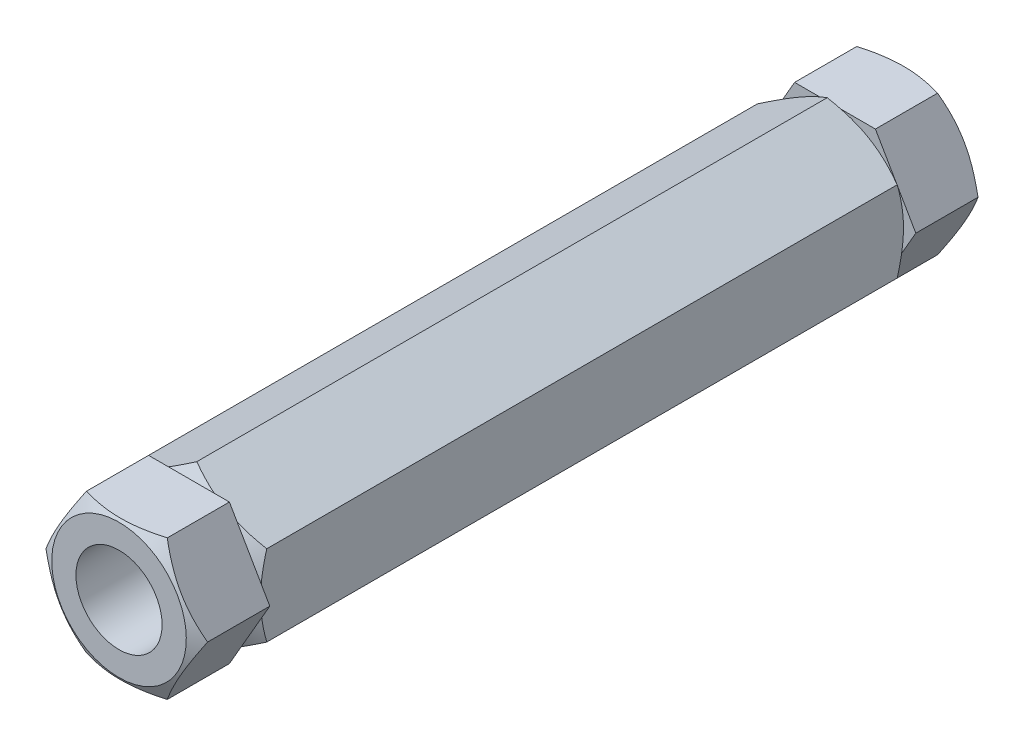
ISO-10303-21;
HEADER;
FILE_DESCRIPTION(('STEP AP214'),'2;1');
FILE_NAME('part.step','',(''),(''),'','','');
FILE_SCHEMA(('AUTOMOTIVE_DESIGN { 1 0 10303 214 1 1 1 1 }'));
ENDSEC;
DATA;
#1=APPLICATION_CONTEXT('core data for automotive mechanical design processes');
#2=APPLICATION_PROTOCOL_DEFINITION('international standard','automotive_design',2000,#1);
#3=PRODUCT_CONTEXT('',#1,'mechanical');
#4=PRODUCT('Part','Part','',(#3));
#5=PRODUCT_RELATED_PRODUCT_CATEGORY('part','',(#4));
#6=PRODUCT_DEFINITION_FORMATION('','',#4);
#7=PRODUCT_DEFINITION_CONTEXT('part definition',#1,'design');
#8=PRODUCT_DEFINITION('design','',#6,#7);
#9=PRODUCT_DEFINITION_SHAPE('','',#8);
#10=(LENGTH_UNIT() NAMED_UNIT(*) SI_UNIT(.MILLI.,.METRE.));
#11=(NAMED_UNIT(*) PLANE_ANGLE_UNIT() SI_UNIT($,.RADIAN.));
#12=(NAMED_UNIT(*) SI_UNIT($,.STERADIAN.) SOLID_ANGLE_UNIT());
#13=UNCERTAINTY_MEASURE_WITH_UNIT(LENGTH_MEASURE(1.E-05),#10,'distance_accuracy_value','');
#14=(GEOMETRIC_REPRESENTATION_CONTEXT(3) GLOBAL_UNCERTAINTY_ASSIGNED_CONTEXT((#13)) GLOBAL_UNIT_ASSIGNED_CONTEXT((#10,
#11,#12)) REPRESENTATION_CONTEXT('',''));
#15=CARTESIAN_POINT('',(0.,0.,0.));
#16=DIRECTION('',(0.,0.,1.));
#17=DIRECTION('',(1.,0.,0.));
#18=AXIS2_PLACEMENT_3D('',#15,#16,#17);
#19=CARTESIAN_POINT('',(0.,0.,73.));
#20=DIRECTION('',(0.,0.,-1.));
#21=DIRECTION('',(0.,1.,0.));
#22=AXIS2_PLACEMENT_3D('',#19,#20,#21);
#23=CONICAL_SURFACE('',#22,6.25,1.0471975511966);
#24=CARTESIAN_POINT('',(-3.75266127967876,6.5002,72.2750391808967));
#25=CARTESIAN_POINT('',(-3.83515161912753,6.35732254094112,72.3226580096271));
#26=CARTESIAN_POINT('',(-3.91794952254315,6.21391236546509,72.3681157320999));
#27=CARTESIAN_POINT('',(-4.08421773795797,5.92592736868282,72.4541137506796));
#28=CARTESIAN_POINT('',(-4.16768832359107,5.78135207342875,72.4946519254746));
#29=CARTESIAN_POINT('',(-4.41943655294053,5.34531134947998,72.6080914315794));
#30=CARTESIAN_POINT('',(-4.58870793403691,5.0521247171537,72.6726146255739));
#31=CARTESIAN_POINT('',(-4.84201947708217,4.61337625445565,72.7482758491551));
#32=CARTESIAN_POINT('',(-4.92530276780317,4.46912536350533,72.7698295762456));
#33=CARTESIAN_POINT('',(-5.09224566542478,4.17997178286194,72.8059721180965));
#34=CARTESIAN_POINT('',(-5.17590523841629,4.03506915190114,72.8205615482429));
#35=CARTESIAN_POINT('',(-5.34336968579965,3.74501222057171,72.8424036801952));
#36=CARTESIAN_POINT('',(-5.427174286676,3.59985839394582,72.8496647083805));
#37=CARTESIAN_POINT('',(-5.59485627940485,3.30942466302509,72.8567021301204));
#38=CARTESIAN_POINT('',(-5.67873366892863,3.16414476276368,72.8564787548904));
#39=CARTESIAN_POINT('',(-5.90853103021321,2.76612405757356,72.8455789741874));
#40=CARTESIAN_POINT('',(-6.05437578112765,2.51351353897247,72.8272806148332));
#41=CARTESIAN_POINT('',(-6.34509659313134,2.00997032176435,72.7692560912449));
#42=CARTESIAN_POINT('',(-6.48997163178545,1.75903939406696,72.7295100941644));
#43=CARTESIAN_POINT('',(-6.78127752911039,1.25448277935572,72.6301565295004));
#44=CARTESIAN_POINT('',(-6.92767163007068,1.00092075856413,72.5701280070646));
#45=CARTESIAN_POINT('',(-7.21827667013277,0.497578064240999,72.4338874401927));
#46=CARTESIAN_POINT('',(-7.36249133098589,0.247790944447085,72.357707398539));
#47=CARTESIAN_POINT('',(-7.50566896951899,-0.000199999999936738,72.2750391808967));
#48=B_SPLINE_CURVE_WITH_KNOTS('',3,(#24,#25,#26,#27,#28,#29,#30,#31,#32,#33,#34,#35,#36,#37,#38,
#39,#40,#41,#42,#43,#44,#45,#46,#47),.UNSPECIFIED.,.F.,.F.,(4,2,2,2,2,2,2,2,2,2,2,4),(0.,
0.515105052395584,1.03043143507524,2.06322554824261,2.56697389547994,3.07067772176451,
3.57380860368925,4.07692394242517,4.95279354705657,5.82947446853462,6.72559912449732,
7.61996451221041),.UNSPECIFIED.);
#49=CARTESIAN_POINT('',(-3.7527767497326,6.5,72.2751058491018));
#50=VERTEX_POINT('',#49);
#51=CARTESIAN_POINT('',(-7.50555349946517,0.,72.2751058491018));
#52=VERTEX_POINT('',#51);
#53=EDGE_CURVE('E407',#50,#52,#48,.T.);
#54=ORIENTED_EDGE('',*,*,#53,.T.);
#55=CARTESIAN_POINT('',(-3.75266127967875,-6.5002,72.2750391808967));
#56=CARTESIAN_POINT('',(-3.83515161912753,-6.35732254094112,72.3226580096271));
#57=CARTESIAN_POINT('',(-3.91794952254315,-6.21391236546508,72.3681157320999));
#58=CARTESIAN_POINT('',(-4.08421773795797,-5.9259273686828,72.4541137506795));
#59=CARTESIAN_POINT('',(-4.16768832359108,-5.78135207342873,72.4946519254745));
#60=CARTESIAN_POINT('',(-4.41943655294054,-5.34531134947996,72.6080914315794));
#61=CARTESIAN_POINT('',(-4.58870793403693,-5.05212471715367,72.6726146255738));
#62=CARTESIAN_POINT('',(-4.84201947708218,-4.61337625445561,72.7482758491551));
#63=CARTESIAN_POINT('',(-4.92530276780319,-4.46912536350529,72.7698295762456));
#64=CARTESIAN_POINT('',(-5.0922456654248,-4.17997178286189,72.8059721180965));
#65=CARTESIAN_POINT('',(-5.17590523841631,-4.03506915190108,72.8205615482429));
#66=CARTESIAN_POINT('',(-5.34336968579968,-3.74501222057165,72.8424036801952));
#67=CARTESIAN_POINT('',(-5.42717428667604,-3.59985839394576,72.8496647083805));
#68=CARTESIAN_POINT('',(-5.59485627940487,-3.30942466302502,72.8567021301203));
#69=CARTESIAN_POINT('',(-5.67873366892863,-3.1641447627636,72.8564787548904));
#70=CARTESIAN_POINT('',(-5.9085310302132,-2.76612405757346,72.8455789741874));
#71=CARTESIAN_POINT('',(-6.05437578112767,-2.51351353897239,72.8272806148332));
#72=CARTESIAN_POINT('',(-6.34509659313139,-2.00997032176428,72.7692560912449));
#73=CARTESIAN_POINT('',(-6.48997163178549,-1.75903939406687,72.7295100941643));
#74=CARTESIAN_POINT('',(-6.78127752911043,-1.25448277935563,72.6301565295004));
#75=CARTESIAN_POINT('',(-6.92767163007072,-1.00092075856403,72.5701280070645));
#76=CARTESIAN_POINT('',(-7.21827667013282,-0.497578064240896,72.4338874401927));
#77=CARTESIAN_POINT('',(-7.36249133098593,-0.247790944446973,72.357707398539));
#78=CARTESIAN_POINT('',(-7.50566896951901,0.000200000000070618,72.2750391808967));
#79=B_SPLINE_CURVE_WITH_KNOTS('',3,(#55,#56,#57,#58,#59,#60,#61,#62,#63,#64,#65,#66,#67,#68,#69,
#70,#71,#72,#73,#74,#75,#76,#77,#78),.UNSPECIFIED.,.F.,.F.,(4,2,2,2,2,2,2,2,2,2,2,4),(0.,
0.515105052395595,1.03043143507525,2.06322554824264,2.56697389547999,3.07067772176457,
3.57380860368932,4.07692394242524,4.95279354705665,5.82947446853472,6.72559912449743,
7.61996451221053),.UNSPECIFIED.);
#80=CARTESIAN_POINT('',(-3.75277674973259,-6.5,72.2751058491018));
#81=VERTEX_POINT('',#80);
#82=EDGE_CURVE('E401',#81,#52,#79,.T.);
#83=ORIENTED_EDGE('',*,*,#82,.F.);
#84=CARTESIAN_POINT('',(-10.0376561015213,-6.5,69.7042245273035));
#85=CARTESIAN_POINT('',(-9.75411250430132,-6.5,69.8415960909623));
#86=CARTESIAN_POINT('',(-9.46991338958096,-6.5,69.977638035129));
#87=CARTESIAN_POINT('',(-8.89985536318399,-6.5,70.24631399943));
#88=CARTESIAN_POINT('',(-8.61399619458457,-6.5,70.3789474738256));
#89=CARTESIAN_POINT('',(-8.03877585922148,-6.5,70.6407342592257));
#90=CARTESIAN_POINT('',(-7.74940407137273,-6.5,70.7698643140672));
#91=CARTESIAN_POINT('',(-7.16834386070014,-6.5,71.0227824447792));
#92=CARTESIAN_POINT('',(-6.87665554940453,-6.5,71.1465707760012));
#93=CARTESIAN_POINT('',(-6.28125325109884,-6.5,71.391192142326));
#94=CARTESIAN_POINT('',(-5.97744998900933,-6.5,71.5118090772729));
#95=CARTESIAN_POINT('',(-5.36627311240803,-6.5,71.7438101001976));
#96=CARTESIAN_POINT('',(-5.05889909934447,-6.5,71.8551931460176));
#97=CARTESIAN_POINT('',(-4.44068218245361,-6.5,72.0657713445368));
#98=CARTESIAN_POINT('',(-4.12984789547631,-6.5,72.164991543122));
#99=CARTESIAN_POINT('',(-3.50371775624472,-6.5,72.3480308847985));
#100=CARTESIAN_POINT('',(-3.1884233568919,-6.5,72.4318549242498));
#101=CARTESIAN_POINT('',(-2.55494944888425,-6.5,72.5796120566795));
#102=CARTESIAN_POINT('',(-2.2367951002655,-6.5,72.6436512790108));
#103=CARTESIAN_POINT('',(-1.59653036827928,-6.5,72.7481736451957));
#104=CARTESIAN_POINT('',(-1.27442034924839,-6.5,72.7886589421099));
#105=CARTESIAN_POINT('',(-0.791708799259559,-6.5,72.8290321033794));
#106=CARTESIAN_POINT('',(-0.631917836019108,-6.5,72.8390964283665));
#107=CARTESIAN_POINT('',(-0.312046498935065,-6.5,72.8524675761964));
#108=CARTESIAN_POINT('',(-0.15196612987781,-6.5,72.8557745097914));
#109=CARTESIAN_POINT('',(0.168189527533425,-6.5,72.855544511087));
#110=CARTESIAN_POINT('',(0.328264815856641,-6.5,72.8520075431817));
#111=CARTESIAN_POINT('',(0.648125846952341,-6.5,72.8381774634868));
#112=CARTESIAN_POINT('',(0.807911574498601,-6.5,72.8278840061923));
#113=CARTESIAN_POINT('',(1.19322981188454,-6.5,72.7951306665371));
#114=CARTESIAN_POINT('',(1.41848933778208,-6.5,72.7693924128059));
#115=CARTESIAN_POINT('',(1.86729775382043,-6.5,72.7059013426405));
#116=CARTESIAN_POINT('',(2.0908464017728,-6.5,72.6681468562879));
#117=CARTESIAN_POINT('',(2.75869205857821,-6.5,72.5388642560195));
#118=CARTESIAN_POINT('',(3.19993162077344,-6.5,72.4313417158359));
#119=CARTESIAN_POINT('',(3.85964942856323,-6.5,72.2453762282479));
#120=CARTESIAN_POINT('',(4.08156176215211,-6.5,72.1784193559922));
#121=CARTESIAN_POINT('',(4.52323021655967,-6.5,72.0376730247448));
#122=CARTESIAN_POINT('',(4.74298632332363,-6.5,71.9638835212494));
#123=CARTESIAN_POINT('',(5.18041384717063,-6.5,71.8106457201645));
#124=CARTESIAN_POINT('',(5.39808595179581,-6.5,71.7311993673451));
#125=CARTESIAN_POINT('',(5.8316348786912,-6.5,71.5675704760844));
#126=CARTESIAN_POINT('',(6.04751172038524,-6.5,71.4833879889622));
#127=CARTESIAN_POINT('',(6.55037775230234,-6.5,71.2819506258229));
#128=CARTESIAN_POINT('',(6.83674035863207,-6.5,71.1631346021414));
#129=CARTESIAN_POINT('',(7.40708826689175,-6.5,70.919911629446));
#130=CARTESIAN_POINT('',(7.69107343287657,-6.5,70.7955043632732));
#131=CARTESIAN_POINT('',(8.25709520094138,-6.5,70.5422033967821));
#132=CARTESIAN_POINT('',(8.53913142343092,-6.5,70.4133088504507));
#133=CARTESIAN_POINT('',(9.10153191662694,-6.5,70.1519160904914));
#134=CARTESIAN_POINT('',(9.3818961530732,-6.5,70.0194178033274));
#135=CARTESIAN_POINT('',(9.94150180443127,-6.5,69.7513494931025));
#136=CARTESIAN_POINT('',(10.2207417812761,-6.5,69.6157764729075));
#137=CARTESIAN_POINT('',(10.7780317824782,-6.5,69.3422041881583));
#138=CARTESIAN_POINT('',(11.0560817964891,-6.5,69.2042049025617));
#139=CARTESIAN_POINT('',(11.8886573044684,-6.5,68.7872382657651));
#140=CARTESIAN_POINT('',(12.4416787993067,-6.5,68.5052680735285));
#141=CARTESIAN_POINT('',(13.4996337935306,-6.5,67.9589862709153));
#142=CARTESIAN_POINT('',(14.0047976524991,-6.5,67.6951188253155));
#143=CARTESIAN_POINT('',(15.0132440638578,-6.5,67.1637753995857));
#144=CARTESIAN_POINT('',(15.5165265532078,-6.5,66.8962992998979));
#145=CARTESIAN_POINT('',(16.5204177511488,-6.5,66.3592347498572));
#146=CARTESIAN_POINT('',(17.0210299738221,-6.5,66.0896528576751));
#147=CARTESIAN_POINT('',(18.0210477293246,-6.5,65.5483221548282));
#148=CARTESIAN_POINT('',(18.5204533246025,-6.5,65.2765734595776));
#149=CARTESIAN_POINT('',(19.0194129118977,-6.5,65.0040137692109));
#150=B_SPLINE_CURVE_WITH_KNOTS('',3,(#84,#85,#86,#87,#88,#89,#90,#91,#92,#93,#94,#95,#96,#97,
#98,#99,#100,#101,#102,#103,#104,#105,#106,#107,#108,#109,#110,#111,#112,#113,#114,#115,#116,
#117,#118,#119,#120,#121,#122,#123,#124,#125,#126,#127,#128,#129,#130,#131,#132,#133,#134,#135,
#136,#137,#138,#139,#140,#141,#142,#143,#144,#145,#146,#147,#148,#149),.UNSPECIFIED.,.F.,.F.,(4,
2,2,2,2,2,2,2,2,2,2,2,2,2,2,2,2,2,2,2,2,2,2,2,2,2,2,2,2,2,2,2,4),(0.,0.945216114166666,
1.89058263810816,2.84116840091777,3.7917086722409,4.77220681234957,5.75281546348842,
6.73136964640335,7.70961208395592,8.68251209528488,9.65532316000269,10.1355247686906,
10.615718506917,11.0959147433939,11.5761355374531,12.2559262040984,12.9358113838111,
14.296353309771,14.9916778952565,15.6870070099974,16.3820982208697,17.0771819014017,
18.0072031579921,18.9372772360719,19.8675276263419,20.7977970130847,21.7290158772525,
22.6602428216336,24.5224617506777,26.2322265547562,27.942048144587,29.647792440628,
31.3534464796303),.UNSPECIFIED.);
#151=CARTESIAN_POINT('',(3.75277674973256,-6.5,72.2751058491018));
#152=VERTEX_POINT('',#151);
#153=EDGE_CURVE('E394',#81,#152,#150,.T.);
#154=ORIENTED_EDGE('',*,*,#153,.T.);
#155=CARTESIAN_POINT('',(3.75266127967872,-6.5002,72.2750391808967));
#156=CARTESIAN_POINT('',(3.8351516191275,-6.35732254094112,72.3226580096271));
#157=CARTESIAN_POINT('',(3.91794952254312,-6.21391236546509,72.3681157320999));
#158=CARTESIAN_POINT('',(4.08421773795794,-5.9259273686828,72.4541137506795));
#159=CARTESIAN_POINT('',(4.16768832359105,-5.78135207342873,72.4946519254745));
#160=CARTESIAN_POINT('',(4.41943655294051,-5.34531134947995,72.6080914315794));
#161=CARTESIAN_POINT('',(4.58870793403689,-5.05212471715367,72.6726146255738));
#162=CARTESIAN_POINT('',(4.84201947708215,-4.61337625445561,72.7482758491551));
#163=CARTESIAN_POINT('',(4.92530276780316,-4.46912536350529,72.7698295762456));
#164=CARTESIAN_POINT('',(5.09224566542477,-4.17997178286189,72.8059721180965));
#165=CARTESIAN_POINT('',(5.17590523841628,-4.03506915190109,72.8205615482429));
#166=CARTESIAN_POINT('',(5.34336968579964,-3.74501222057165,72.8424036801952));
#167=CARTESIAN_POINT('',(5.42717428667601,-3.59985839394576,72.8496647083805));
#168=CARTESIAN_POINT('',(5.59485627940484,-3.30942466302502,72.8567021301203));
#169=CARTESIAN_POINT('',(5.67873366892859,-3.1641447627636,72.8564787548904));
#170=CARTESIAN_POINT('',(5.90853103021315,-2.76612405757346,72.8455789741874));
#171=CARTESIAN_POINT('',(6.05437578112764,-2.51351353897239,72.8272806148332));
#172=CARTESIAN_POINT('',(6.34509659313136,-2.00997032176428,72.7692560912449));
#173=CARTESIAN_POINT('',(6.48997163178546,-1.75903939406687,72.7295100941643));
#174=CARTESIAN_POINT('',(6.7812775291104,-1.25448277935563,72.6301565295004));
#175=CARTESIAN_POINT('',(6.92767163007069,-1.00092075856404,72.5701280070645));
#176=CARTESIAN_POINT('',(7.21827667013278,-0.497578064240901,72.4338874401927));
#177=CARTESIAN_POINT('',(7.3624913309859,-0.247790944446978,72.357707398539));
#178=CARTESIAN_POINT('',(7.50566896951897,0.000200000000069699,72.2750391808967));
#179=B_SPLINE_CURVE_WITH_KNOTS('',3,(#155,#156,#157,#158,#159,#160,#161,#162,#163,#164,#165,
#166,#167,#168,#169,#170,#171,#172,#173,#174,#175,#176,#177,#178),.UNSPECIFIED.,.F.,.F.,(4,2,2,
2,2,2,2,2,2,2,2,4),(0.,0.515105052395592,1.03043143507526,2.06322554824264,2.56697389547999,
3.07067772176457,3.57380860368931,4.07692394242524,4.95279354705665,5.82947446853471,
6.72559912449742,7.61996451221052),.UNSPECIFIED.);
#180=CARTESIAN_POINT('',(7.50555349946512,0.,72.2751058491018));
#181=VERTEX_POINT('',#180);
#182=EDGE_CURVE('E34',#152,#181,#179,.T.);
#183=ORIENTED_EDGE('',*,*,#182,.T.);
#184=CARTESIAN_POINT('',(3.75266127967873,6.5002,72.2750391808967));
#185=CARTESIAN_POINT('',(3.8351516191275,6.35732254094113,72.3226580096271));
#186=CARTESIAN_POINT('',(3.91794952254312,6.2139123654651,72.3681157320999));
#187=CARTESIAN_POINT('',(4.08421773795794,5.92592736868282,72.4541137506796));
#188=CARTESIAN_POINT('',(4.16768832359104,5.78135207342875,72.4946519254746));
#189=CARTESIAN_POINT('',(4.4194365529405,5.34531134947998,72.6080914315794));
#190=CARTESIAN_POINT('',(4.58870793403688,5.0521247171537,72.6726146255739));
#191=CARTESIAN_POINT('',(4.84201947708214,4.61337625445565,72.7482758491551));
#192=CARTESIAN_POINT('',(4.92530276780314,4.46912536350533,72.7698295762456));
#193=CARTESIAN_POINT('',(5.09224566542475,4.17997178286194,72.8059721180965));
#194=CARTESIAN_POINT('',(5.17590523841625,4.03506915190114,72.8205615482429));
#195=CARTESIAN_POINT('',(5.34336968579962,3.74501222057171,72.8424036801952));
#196=CARTESIAN_POINT('',(5.42717428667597,3.59985839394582,72.8496647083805));
#197=CARTESIAN_POINT('',(5.59485627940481,3.30942466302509,72.8567021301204));
#198=CARTESIAN_POINT('',(5.67873366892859,3.16414476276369,72.8564787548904));
#199=CARTESIAN_POINT('',(5.90853103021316,2.76612405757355,72.8455789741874));
#200=CARTESIAN_POINT('',(6.05437578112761,2.51351353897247,72.8272806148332));
#201=CARTESIAN_POINT('',(6.34509659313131,2.00997032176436,72.7692560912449));
#202=CARTESIAN_POINT('',(6.48997163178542,1.75903939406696,72.7295100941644));
#203=CARTESIAN_POINT('',(6.78127752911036,1.25448277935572,72.6301565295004));
#204=CARTESIAN_POINT('',(6.92767163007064,1.00092075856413,72.5701280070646));
#205=CARTESIAN_POINT('',(7.21827667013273,0.497578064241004,72.4338874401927));
#206=CARTESIAN_POINT('',(7.36249133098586,0.247790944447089,72.357707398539));
#207=CARTESIAN_POINT('',(7.50566896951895,-0.000199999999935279,72.2750391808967));
#208=B_SPLINE_CURVE_WITH_KNOTS('',3,(#184,#185,#186,#187,#188,#189,#190,#191,#192,#193,#194,
#195,#196,#197,#198,#199,#200,#201,#202,#203,#204,#205,#206,#207),.UNSPECIFIED.,.F.,.F.,(4,2,2,
2,2,2,2,2,2,2,2,4),(0.,0.515105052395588,1.03043143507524,2.06322554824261,2.56697389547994,
3.07067772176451,3.57380860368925,4.07692394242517,4.95279354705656,5.82947446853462,
6.72559912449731,7.61996451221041),.UNSPECIFIED.);
#209=CARTESIAN_POINT('',(3.75277674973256,6.5,72.2751058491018));
#210=VERTEX_POINT('',#209);
#211=EDGE_CURVE('E376',#210,#181,#208,.T.);
#212=ORIENTED_EDGE('',*,*,#211,.F.);
#213=CARTESIAN_POINT('',(-10.0376561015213,6.5,69.7042245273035));
#214=CARTESIAN_POINT('',(-9.75411250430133,6.5,69.8415960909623));
#215=CARTESIAN_POINT('',(-9.46991338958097,6.5,69.977638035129));
#216=CARTESIAN_POINT('',(-8.899855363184,6.5,70.2463139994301));
#217=CARTESIAN_POINT('',(-8.61399619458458,6.5,70.3789474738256));
#218=CARTESIAN_POINT('',(-8.03877585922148,6.5,70.6407342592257));
#219=CARTESIAN_POINT('',(-7.74940407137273,6.5,70.7698643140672));
#220=CARTESIAN_POINT('',(-7.16834386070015,6.5,71.0227824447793));
#221=CARTESIAN_POINT('',(-6.87665554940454,6.5,71.1465707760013));
#222=CARTESIAN_POINT('',(-6.28125325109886,6.5,71.3911921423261));
#223=CARTESIAN_POINT('',(-5.97744998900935,6.5,71.5118090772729));
#224=CARTESIAN_POINT('',(-5.36627311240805,6.5,71.7438101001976));
#225=CARTESIAN_POINT('',(-5.05889909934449,6.5,71.8551931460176));
#226=CARTESIAN_POINT('',(-4.44068218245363,6.5,72.0657713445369));
#227=CARTESIAN_POINT('',(-4.12984789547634,6.5,72.1649915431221));
#228=CARTESIAN_POINT('',(-3.50371775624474,6.5,72.3480308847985));
#229=CARTESIAN_POINT('',(-3.18842335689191,6.5,72.4318549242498));
#230=CARTESIAN_POINT('',(-2.55494944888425,6.5,72.5796120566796));
#231=CARTESIAN_POINT('',(-2.23679510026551,6.5,72.6436512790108));
#232=CARTESIAN_POINT('',(-1.59653036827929,6.5,72.7481736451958));
#233=CARTESIAN_POINT('',(-1.2744203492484,6.5,72.7886589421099));
#234=CARTESIAN_POINT('',(-0.791708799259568,6.5,72.8290321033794));
#235=CARTESIAN_POINT('',(-0.631917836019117,6.5,72.8390964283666));
#236=CARTESIAN_POINT('',(-0.312046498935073,6.5,72.8524675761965));
#237=CARTESIAN_POINT('',(-0.151966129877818,6.5,72.8557745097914));
#238=CARTESIAN_POINT('',(0.16818952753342,6.5,72.855544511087));
#239=CARTESIAN_POINT('',(0.328264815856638,6.5,72.8520075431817));
#240=CARTESIAN_POINT('',(0.64812584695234,6.5,72.8381774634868));
#241=CARTESIAN_POINT('',(0.807911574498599,6.5,72.8278840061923));
#242=CARTESIAN_POINT('',(1.19322981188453,6.5,72.7951306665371));
#243=CARTESIAN_POINT('',(1.41848933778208,6.5,72.7693924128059));
#244=CARTESIAN_POINT('',(1.86729775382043,6.5,72.7059013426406));
#245=CARTESIAN_POINT('',(2.09084640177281,6.5,72.6681468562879));
#246=CARTESIAN_POINT('',(2.75869205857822,6.5,72.5388642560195));
#247=CARTESIAN_POINT('',(3.19993162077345,6.5,72.4313417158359));
#248=CARTESIAN_POINT('',(3.85964942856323,6.5,72.2453762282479));
#249=CARTESIAN_POINT('',(4.08156176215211,6.5,72.1784193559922));
#250=CARTESIAN_POINT('',(4.52323021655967,6.5,72.0376730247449));
#251=CARTESIAN_POINT('',(4.74298632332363,6.5,71.9638835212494));
#252=CARTESIAN_POINT('',(5.18041384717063,6.5,71.8106457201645));
#253=CARTESIAN_POINT('',(5.39808595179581,6.5,71.7311993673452));
#254=CARTESIAN_POINT('',(5.8316348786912,6.5,71.5675704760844));
#255=CARTESIAN_POINT('',(6.04751172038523,6.5,71.4833879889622));
#256=CARTESIAN_POINT('',(6.55037775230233,6.5,71.2819506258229));
#257=CARTESIAN_POINT('',(6.83674035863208,6.5,71.1631346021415));
#258=CARTESIAN_POINT('',(7.40708826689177,6.5,70.9199116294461));
#259=CARTESIAN_POINT('',(7.69107343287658,6.5,70.7955043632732));
#260=CARTESIAN_POINT('',(8.25709520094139,6.5,70.5422033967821));
#261=CARTESIAN_POINT('',(8.53913142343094,6.5,70.4133088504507));
#262=CARTESIAN_POINT('',(9.10153191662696,6.5,70.1519160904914));
#263=CARTESIAN_POINT('',(9.38189615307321,6.5,70.0194178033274));
#264=CARTESIAN_POINT('',(9.94150180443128,6.5,69.7513494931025));
#265=CARTESIAN_POINT('',(10.2207417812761,6.5,69.6157764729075));
#266=CARTESIAN_POINT('',(10.7780317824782,6.5,69.3422041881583));
#267=CARTESIAN_POINT('',(11.0560817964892,6.5,69.2042049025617));
#268=CARTESIAN_POINT('',(11.8886573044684,6.5,68.7872382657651));
#269=CARTESIAN_POINT('',(12.4416787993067,6.5,68.5052680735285));
#270=CARTESIAN_POINT('',(13.4996337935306,6.5,67.9589862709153));
#271=CARTESIAN_POINT('',(14.0047976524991,6.5,67.6951188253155));
#272=CARTESIAN_POINT('',(15.0132440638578,6.5,67.1637753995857));
#273=CARTESIAN_POINT('',(15.5165265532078,6.5,66.8962992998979));
#274=CARTESIAN_POINT('',(16.5204177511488,6.5,66.3592347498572));
#275=CARTESIAN_POINT('',(17.0210299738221,6.5,66.0896528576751));
#276=CARTESIAN_POINT('',(18.0210477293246,6.5,65.5483221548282));
#277=CARTESIAN_POINT('',(18.5204533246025,6.5,65.2765734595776));
#278=CARTESIAN_POINT('',(19.0194129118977,6.5,65.0040137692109));
#279=B_SPLINE_CURVE_WITH_KNOTS('',3,(#213,#214,#215,#216,#217,#218,#219,#220,#221,#222,#223,
#224,#225,#226,#227,#228,#229,#230,#231,#232,#233,#234,#235,#236,#237,#238,#239,#240,#241,#242,
#243,#244,#245,#246,#247,#248,#249,#250,#251,#252,#253,#254,#255,#256,#257,#258,#259,#260,#261,
#262,#263,#264,#265,#266,#267,#268,#269,#270,#271,#272,#273,#274,#275,#276,#277,#278),
.UNSPECIFIED.,.F.,.F.,(4,2,2,2,2,2,2,2,2,2,2,2,2,2,2,2,2,2,2,2,2,2,2,2,2,2,2,2,2,2,2,2,4),(0.,
0.945216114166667,1.89058263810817,2.84116840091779,3.79170867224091,4.77220681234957,
5.75281546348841,6.73136964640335,7.70961208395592,8.68251209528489,9.6553231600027,
10.1355247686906,10.615718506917,11.0959147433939,11.5761355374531,12.2559262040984,
12.9358113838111,14.296353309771,14.9916778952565,15.6870070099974,16.3820982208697,
17.0771819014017,18.0072031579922,18.9372772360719,19.867527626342,20.7977970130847,
21.7290158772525,22.6602428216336,24.5224617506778,26.2322265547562,27.942048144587,
29.6477924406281,31.3534464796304),.UNSPECIFIED.);
#280=EDGE_CURVE('E412',#50,#210,#279,.T.);
#281=ORIENTED_EDGE('',*,*,#280,.F.);
#282=EDGE_LOOP('',(#54,#83,#154,#183,#212,#281));
#283=FACE_BOUND('',#282,.T.);
#284=CARTESIAN_POINT('',(0.,0.,73.));
#285=DIRECTION('',(0.,0.,1.));
#286=DIRECTION('',(0.,-1.,0.));
#287=AXIS2_PLACEMENT_3D('',#284,#285,#286);
#288=CIRCLE('',#287,6.25);
#289=CARTESIAN_POINT('',(0.,-6.24999999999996,73.));
#290=VERTEX_POINT('',#289);
#291=EDGE_CURVE('E488',#290,#290,#288,.T.);
#292=ORIENTED_EDGE('',*,*,#291,.F.);
#293=EDGE_LOOP('',(#292));
#294=FACE_BOUND('',#293,.T.);
#295=ADVANCED_FACE('F14',(#283,#294),#23,.T.);
#296=CARTESIAN_POINT('',(3.75277674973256,6.5,73.));
#297=DIRECTION('',(0.,0.,1.));
#298=DIRECTION('',(0.,-1.,0.));
#299=AXIS2_PLACEMENT_3D('',#296,#297,#298);
#300=PLANE('',#299);
#301=CARTESIAN_POINT('',(0.,0.,73.));
#302=DIRECTION('',(0.,0.,1.));
#303=DIRECTION('',(0.,-1.,0.));
#304=AXIS2_PLACEMENT_3D('',#301,#302,#303);
#305=CIRCLE('',#304,4.);
#306=CARTESIAN_POINT('',(0.,-3.99999999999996,73.));
#307=VERTEX_POINT('',#306);
#308=EDGE_CURVE('E420',#307,#307,#305,.T.);
#309=ORIENTED_EDGE('',*,*,#308,.F.);
#310=EDGE_LOOP('',(#309));
#311=FACE_BOUND('',#310,.T.);
#312=ORIENTED_EDGE('',*,*,#291,.T.);
#313=EDGE_LOOP('',(#312));
#314=FACE_BOUND('',#313,.T.);
#315=ADVANCED_FACE('F360',(#311,#314),#300,.T.);
#316=CARTESIAN_POINT('',(0.,0.,73.));
#317=DIRECTION('',(0.,0.,-1.));
#318=DIRECTION('',(-1.,0.,0.));
#319=AXIS2_PLACEMENT_3D('',#316,#317,#318);
#320=CYLINDRICAL_SURFACE('',#319,4.);
#321=ORIENTED_EDGE('',*,*,#308,.T.);
#322=EDGE_LOOP('',(#321));
#323=FACE_BOUND('',#322,.T.);
#324=CARTESIAN_POINT('',(0.,0.,0.));
#325=DIRECTION('',(0.,0.,-1.));
#326=DIRECTION('',(0.,1.,0.));
#327=AXIS2_PLACEMENT_3D('',#324,#325,#326);
#328=CIRCLE('',#327,4.);
#329=CARTESIAN_POINT('',(0.,4.,0.));
#330=VERTEX_POINT('',#329);
#331=EDGE_CURVE('E519',#330,#330,#328,.T.);
#332=ORIENTED_EDGE('',*,*,#331,.T.);
#333=EDGE_LOOP('',(#332));
#334=FACE_BOUND('',#333,.T.);
#335=ADVANCED_FACE('F366',(#323,#334),#320,.F.);
#336=CARTESIAN_POINT('',(3.75277674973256,-6.5,73.));
#337=DIRECTION('',(-0.86602540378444,0.5,0.));
#338=DIRECTION('',(-0.5,-0.86602540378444,0.));
#339=AXIS2_PLACEMENT_3D('',#336,#337,#338);
#340=PLANE('',#339);
#341=DIRECTION('',(-0.5,-0.86602540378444,0.));
#342=VECTOR('',#341,1.);
#343=CARTESIAN_POINT('',(7.50555349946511,0.,66.5));
#344=LINE('',#343,#342);
#345=CARTESIAN_POINT('',(7.50555349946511,0.,66.5));
#346=VERTEX_POINT('',#345);
#347=CARTESIAN_POINT('',(3.75277674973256,-6.5,66.5));
#348=VERTEX_POINT('',#347);
#349=EDGE_CURVE('E474',#346,#348,#344,.T.);
#350=ORIENTED_EDGE('',*,*,#349,.F.);
#351=DIRECTION('',(0.,0.,-1.));
#352=VECTOR('',#351,1.);
#353=CARTESIAN_POINT('',(7.50555349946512,0.,73.));
#354=LINE('',#353,#352);
#355=EDGE_CURVE('E506',#181,#346,#354,.T.);
#356=ORIENTED_EDGE('',*,*,#355,.F.);
#357=ORIENTED_EDGE('',*,*,#182,.F.);
#358=DIRECTION('',(0.,0.,-1.));
#359=VECTOR('',#358,1.);
#360=CARTESIAN_POINT('',(3.75277674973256,-6.5,73.));
#361=LINE('',#360,#359);
#362=EDGE_CURVE('E501',#152,#348,#361,.T.);
#363=ORIENTED_EDGE('',*,*,#362,.T.);
#364=EDGE_LOOP('',(#350,#356,#357,#363));
#365=FACE_BOUND('',#364,.T.);
#366=ADVANCED_FACE('F430',(#365),#340,.F.);
#367=CARTESIAN_POINT('',(3.75277674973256,6.5,73.));
#368=DIRECTION('',(0.866025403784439,0.5,0.));
#369=DIRECTION('',(-0.5,0.866025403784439,0.));
#370=AXIS2_PLACEMENT_3D('',#367,#368,#369);
#371=PLANE('',#370);
#372=DIRECTION('',(0.5,-0.866025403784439,0.));
#373=VECTOR('',#372,1.);
#374=CARTESIAN_POINT('',(3.75277674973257,6.5,66.5));
#375=LINE('',#374,#373);
#376=CARTESIAN_POINT('',(3.75277674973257,6.5,66.5));
#377=VERTEX_POINT('',#376);
#378=EDGE_CURVE('E486',#377,#346,#375,.T.);
#379=ORIENTED_EDGE('',*,*,#378,.F.);
#380=DIRECTION('',(0.,0.,-1.));
#381=VECTOR('',#380,1.);
#382=CARTESIAN_POINT('',(3.75277674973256,6.5,73.));
#383=LINE('',#382,#381);
#384=EDGE_CURVE('E507',#210,#377,#383,.T.);
#385=ORIENTED_EDGE('',*,*,#384,.F.);
#386=ORIENTED_EDGE('',*,*,#211,.T.);
#387=ORIENTED_EDGE('',*,*,#355,.T.);
#388=EDGE_LOOP('',(#379,#385,#386,#387));
#389=FACE_BOUND('',#388,.T.);
#390=ADVANCED_FACE('F426',(#389),#371,.T.);
#391=CARTESIAN_POINT('',(-3.7527767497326,6.5,73.));
#392=DIRECTION('',(0.,1.,0.));
#393=DIRECTION('',(0.,0.,1.));
#394=AXIS2_PLACEMENT_3D('',#391,#392,#393);
#395=PLANE('',#394);
#396=DIRECTION('',(1.,0.,0.));
#397=VECTOR('',#396,1.);
#398=CARTESIAN_POINT('',(-3.75277674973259,6.5,66.5));
#399=LINE('',#398,#397);
#400=CARTESIAN_POINT('',(-3.75277674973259,6.5,66.5));
#401=VERTEX_POINT('',#400);
#402=EDGE_CURVE('E483',#401,#377,#399,.T.);
#403=ORIENTED_EDGE('',*,*,#402,.F.);
#404=DIRECTION('',(0.,0.,-1.));
#405=VECTOR('',#404,1.);
#406=CARTESIAN_POINT('',(-3.7527767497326,6.5,73.));
#407=LINE('',#406,#405);
#408=EDGE_CURVE('E25',#50,#401,#407,.T.);
#409=ORIENTED_EDGE('',*,*,#408,.F.);
#410=ORIENTED_EDGE('',*,*,#280,.T.);
#411=ORIENTED_EDGE('',*,*,#384,.T.);
#412=EDGE_LOOP('',(#403,#409,#410,#411));
#413=FACE_BOUND('',#412,.T.);
#414=ADVANCED_FACE('F422',(#413),#395,.T.);
#415=CARTESIAN_POINT('',(-3.7527767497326,6.5,73.));
#416=DIRECTION('',(0.866025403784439,-0.5,0.));
#417=DIRECTION('',(0.5,0.866025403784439,0.));
#418=AXIS2_PLACEMENT_3D('',#415,#416,#417);
#419=PLANE('',#418);
#420=DIRECTION('',(0.5,0.866025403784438,0.));
#421=VECTOR('',#420,1.);
#422=CARTESIAN_POINT('',(-7.50555349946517,0.,66.5));
#423=LINE('',#422,#421);
#424=CARTESIAN_POINT('',(-7.50555349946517,0.,66.5));
#425=VERTEX_POINT('',#424);
#426=EDGE_CURVE('E465',#425,#401,#423,.T.);
#427=ORIENTED_EDGE('',*,*,#426,.F.);
#428=DIRECTION('',(0.,0.,-1.));
#429=VECTOR('',#428,1.);
#430=CARTESIAN_POINT('',(-7.50555349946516,0.,73.));
#431=LINE('',#430,#429);
#432=EDGE_CURVE('E460',#52,#425,#431,.T.);
#433=ORIENTED_EDGE('',*,*,#432,.F.);
#434=ORIENTED_EDGE('',*,*,#53,.F.);
#435=ORIENTED_EDGE('',*,*,#408,.T.);
#436=EDGE_LOOP('',(#427,#433,#434,#435));
#437=FACE_BOUND('',#436,.T.);
#438=ADVANCED_FACE('F211',(#437),#419,.F.);
#439=CARTESIAN_POINT('',(-3.75277674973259,-6.5,73.));
#440=DIRECTION('',(-0.86602540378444,-0.5,0.));
#441=DIRECTION('',(0.5,-0.86602540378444,0.));
#442=AXIS2_PLACEMENT_3D('',#439,#440,#441);
#443=PLANE('',#442);
#444=DIRECTION('',(-0.5,0.866025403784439,0.));
#445=VECTOR('',#444,1.);
#446=CARTESIAN_POINT('',(-3.75277674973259,-6.5,66.5));
#447=LINE('',#446,#445);
#448=CARTESIAN_POINT('',(-3.75277674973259,-6.5,66.5));
#449=VERTEX_POINT('',#448);
#450=EDGE_CURVE('E452',#449,#425,#447,.T.);
#451=ORIENTED_EDGE('',*,*,#450,.F.);
#452=DIRECTION('',(0.,0.,-1.));
#453=VECTOR('',#452,1.);
#454=CARTESIAN_POINT('',(-3.75277674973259,-6.5,73.));
#455=LINE('',#454,#453);
#456=EDGE_CURVE('E457',#81,#449,#455,.T.);
#457=ORIENTED_EDGE('',*,*,#456,.F.);
#458=ORIENTED_EDGE('',*,*,#82,.T.);
#459=ORIENTED_EDGE('',*,*,#432,.T.);
#460=EDGE_LOOP('',(#451,#457,#458,#459));
#461=FACE_BOUND('',#460,.T.);
#462=ADVANCED_FACE('F438',(#461),#443,.T.);
#463=CARTESIAN_POINT('',(-3.75277674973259,-6.5,73.));
#464=DIRECTION('',(0.,1.,0.));
#465=DIRECTION('',(0.,0.,1.));
#466=AXIS2_PLACEMENT_3D('',#463,#464,#465);
#467=PLANE('',#466);
#468=DIRECTION('',(-1.,0.,0.));
#469=VECTOR('',#468,1.);
#470=CARTESIAN_POINT('',(3.75277674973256,-6.5,66.5));
#471=LINE('',#470,#469);
#472=EDGE_CURVE('E466',#348,#449,#471,.T.);
#473=ORIENTED_EDGE('',*,*,#472,.F.);
#474=ORIENTED_EDGE('',*,*,#362,.F.);
#475=ORIENTED_EDGE('',*,*,#153,.F.);
#476=ORIENTED_EDGE('',*,*,#456,.T.);
#477=EDGE_LOOP('',(#473,#474,#475,#476));
#478=FACE_BOUND('',#477,.T.);
#479=ADVANCED_FACE('F435',(#478),#467,.F.);
#480=CARTESIAN_POINT('',(11.2583302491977,6.5,66.5));
#481=DIRECTION('',(0.,0.,1.));
#482=DIRECTION('',(1.,0.,0.));
#483=AXIS2_PLACEMENT_3D('',#480,#481,#482);
#484=PLANE('',#483);
#485=ORIENTED_EDGE('',*,*,#472,.T.);
#486=ORIENTED_EDGE('',*,*,#450,.T.);
#487=ORIENTED_EDGE('',*,*,#426,.T.);
#488=ORIENTED_EDGE('',*,*,#402,.T.);
#489=ORIENTED_EDGE('',*,*,#378,.T.);
#490=ORIENTED_EDGE('',*,*,#349,.T.);
#491=EDGE_LOOP('',(#485,#486,#487,#488,#489,#490));
#492=FACE_BOUND('',#491,.T.);
#493=CARTESIAN_POINT('',(0.,0.,66.5));
#494=DIRECTION('',(0.,0.,-1.));
#495=DIRECTION('',(1.,0.,0.));
#496=AXIS2_PLACEMENT_3D('',#493,#494,#495);
#497=CIRCLE('',#496,6.25);
#498=CARTESIAN_POINT('',(6.24999999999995,0.,66.5));
#499=VERTEX_POINT('',#498);
#500=EDGE_CURVE('E9',#499,#499,#497,.T.);
#501=ORIENTED_EDGE('',*,*,#500,.F.);
#502=EDGE_LOOP('',(#501));
#503=FACE_BOUND('',#502,.T.);
#504=ADVANCED_FACE('F210',(#492,#503),#484,.F.);
#505=CARTESIAN_POINT('',(-3.75277674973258,-6.5,0.));
#506=DIRECTION('',(0.,-1.,0.));
#507=DIRECTION('',(0.,0.,-1.));
#508=AXIS2_PLACEMENT_3D('',#505,#506,#507);
#509=PLANE('',#508);
#510=DIRECTION('',(1.,0.,0.));
#511=VECTOR('',#510,1.);
#512=CARTESIAN_POINT('',(-3.75277674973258,-6.5,6.5));
#513=LINE('',#512,#511);
#514=CARTESIAN_POINT('',(-3.75277674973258,-6.5,6.5));
#515=VERTEX_POINT('',#514);
#516=CARTESIAN_POINT('',(3.75277674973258,-6.5,6.5));
#517=VERTEX_POINT('',#516);
#518=EDGE_CURVE('E172',#515,#517,#513,.T.);
#519=ORIENTED_EDGE('',*,*,#518,.F.);
#520=DIRECTION('',(0.,0.,1.));
#521=VECTOR('',#520,1.);
#522=CARTESIAN_POINT('',(-3.75277674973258,-6.5,0.));
#523=LINE('',#522,#521);
#524=CARTESIAN_POINT('',(-3.75277674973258,-6.5,0.724894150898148));
#525=VERTEX_POINT('',#524);
#526=EDGE_CURVE('E479',#525,#515,#523,.T.);
#527=ORIENTED_EDGE('',*,*,#526,.F.);
#528=CARTESIAN_POINT('',(-10.0376561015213,-6.5,3.2957754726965));
#529=CARTESIAN_POINT('',(-9.75411250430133,-6.5,3.15840390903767));
#530=CARTESIAN_POINT('',(-9.46991338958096,-6.5,3.022361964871));
#531=CARTESIAN_POINT('',(-8.89985536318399,-6.5,2.75368600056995));
#532=CARTESIAN_POINT('',(-8.61399619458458,-6.5,2.62105252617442));
#533=CARTESIAN_POINT('',(-8.03877585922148,-6.5,2.35926574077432));
#534=CARTESIAN_POINT('',(-7.74940407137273,-6.5,2.2301356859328));
#535=CARTESIAN_POINT('',(-7.16834386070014,-6.5,1.97721755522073));
#536=CARTESIAN_POINT('',(-6.87665554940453,-6.5,1.85342922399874));
#537=CARTESIAN_POINT('',(-6.28125325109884,-6.5,1.60880785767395));
#538=CARTESIAN_POINT('',(-5.97744998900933,-6.5,1.48819092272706));
#539=CARTESIAN_POINT('',(-5.36627311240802,-6.5,1.25618989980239));
#540=CARTESIAN_POINT('',(-5.05889909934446,-6.5,1.14480685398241));
#541=CARTESIAN_POINT('',(-4.4406821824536,-6.5,0.934228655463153));
#542=CARTESIAN_POINT('',(-4.1298478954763,-6.5,0.835008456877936));
#543=CARTESIAN_POINT('',(-3.50371775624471,-6.5,0.65196911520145));
#544=CARTESIAN_POINT('',(-3.18842335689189,-6.5,0.568145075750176));
#545=CARTESIAN_POINT('',(-2.55494944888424,-6.5,0.420387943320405));
#546=CARTESIAN_POINT('',(-2.23679510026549,-6.5,0.356348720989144));
#547=CARTESIAN_POINT('',(-1.59653036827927,-6.5,0.251826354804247));
#548=CARTESIAN_POINT('',(-1.27442034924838,-6.5,0.211341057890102));
#549=CARTESIAN_POINT('',(-0.791708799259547,-6.5,0.170967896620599));
#550=CARTESIAN_POINT('',(-0.631917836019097,-6.5,0.160903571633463));
#551=CARTESIAN_POINT('',(-0.312046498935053,-6.5,0.147532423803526));
#552=CARTESIAN_POINT('',(-0.151966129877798,-6.5,0.144225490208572));
#553=CARTESIAN_POINT('',(0.168189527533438,-6.5,0.144455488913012));
#554=CARTESIAN_POINT('',(0.328264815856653,-6.5,0.147992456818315));
#555=CARTESIAN_POINT('',(0.648125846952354,-6.5,0.161822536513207));
#556=CARTESIAN_POINT('',(0.807911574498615,-6.5,0.172115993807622));
#557=CARTESIAN_POINT('',(1.19322981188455,-6.5,0.204869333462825));
#558=CARTESIAN_POINT('',(1.41848933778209,-6.5,0.230607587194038));
#559=CARTESIAN_POINT('',(1.86729775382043,-6.5,0.294098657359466));
#560=CARTESIAN_POINT('',(2.09084640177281,-6.5,0.331853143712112));
#561=CARTESIAN_POINT('',(2.75869205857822,-6.5,0.461135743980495));
#562=CARTESIAN_POINT('',(3.19993162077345,-6.5,0.56865828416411));
#563=CARTESIAN_POINT('',(3.85964942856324,-6.5,0.754623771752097));
#564=CARTESIAN_POINT('',(4.08156176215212,-6.5,0.821580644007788));
#565=CARTESIAN_POINT('',(4.52323021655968,-6.5,0.962326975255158));
#566=CARTESIAN_POINT('',(4.74298632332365,-6.5,1.03611647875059));
#567=CARTESIAN_POINT('',(5.18041384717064,-6.5,1.18935427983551));
#568=CARTESIAN_POINT('',(5.39808595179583,-6.5,1.26880063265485));
#569=CARTESIAN_POINT('',(5.83163487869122,-6.5,1.4324295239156));
#570=CARTESIAN_POINT('',(6.04751172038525,-6.5,1.51661201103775));
#571=CARTESIAN_POINT('',(6.55037775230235,-6.5,1.71804937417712));
#572=CARTESIAN_POINT('',(6.83674035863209,-6.5,1.83686539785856));
#573=CARTESIAN_POINT('',(7.40708826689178,-6.5,2.08008837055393));
#574=CARTESIAN_POINT('',(7.69107343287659,-6.5,2.2044956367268));
#575=CARTESIAN_POINT('',(8.2570952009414,-6.5,2.45779660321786));
#576=CARTESIAN_POINT('',(8.53913142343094,-6.5,2.58669114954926));
#577=CARTESIAN_POINT('',(9.10153191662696,-6.5,2.8480839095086));
#578=CARTESIAN_POINT('',(9.38189615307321,-6.5,2.98058219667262));
#579=CARTESIAN_POINT('',(9.94150180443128,-6.5,3.24865050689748));
#580=CARTESIAN_POINT('',(10.2207417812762,-6.5,3.38422352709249));
#581=CARTESIAN_POINT('',(10.7780317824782,-6.5,3.6577958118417));
#582=CARTESIAN_POINT('',(11.0560817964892,-6.5,3.79579509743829));
#583=CARTESIAN_POINT('',(11.8886573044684,-6.5,4.21276173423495));
#584=CARTESIAN_POINT('',(12.4416787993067,-6.5,4.49473192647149));
#585=CARTESIAN_POINT('',(13.4996337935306,-6.5,5.0410137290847));
#586=CARTESIAN_POINT('',(14.0047976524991,-6.5,5.3048811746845));
#587=CARTESIAN_POINT('',(15.0132440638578,-6.5,5.8362246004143));
#588=CARTESIAN_POINT('',(15.5165265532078,-6.5,6.10370070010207));
#589=CARTESIAN_POINT('',(16.5204177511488,-6.5,6.64076525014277));
#590=CARTESIAN_POINT('',(17.0210299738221,-6.5,6.91034714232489));
#591=CARTESIAN_POINT('',(18.0210477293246,-6.5,7.45167784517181));
#592=CARTESIAN_POINT('',(18.5204533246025,-6.5,7.7234265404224));
#593=CARTESIAN_POINT('',(19.0194129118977,-6.5,7.99598623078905));
#594=B_SPLINE_CURVE_WITH_KNOTS('',3,(#528,#529,#530,#531,#532,#533,#534,#535,#536,#537,#538,
#539,#540,#541,#542,#543,#544,#545,#546,#547,#548,#549,#550,#551,#552,#553,#554,#555,#556,#557,
#558,#559,#560,#561,#562,#563,#564,#565,#566,#567,#568,#569,#570,#571,#572,#573,#574,#575,#576,
#577,#578,#579,#580,#581,#582,#583,#584,#585,#586,#587,#588,#589,#590,#591,#592,#593),
.UNSPECIFIED.,.F.,.F.,(4,2,2,2,2,2,2,2,2,2,2,2,2,2,2,2,2,2,2,2,2,2,2,2,2,2,2,2,2,2,2,2,4),(0.,
0.94521611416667,1.89058263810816,2.84116840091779,3.79170867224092,4.77220681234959,
5.75281546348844,6.73136964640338,7.70961208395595,8.6825120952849,9.65532316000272,
10.1355247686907,10.615718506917,11.0959147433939,11.5761355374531,12.2559262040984,
12.9358113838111,14.296353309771,14.9916778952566,15.6870070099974,16.3820982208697,
17.0771819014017,18.0072031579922,18.9372772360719,19.867527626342,20.7977970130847,
21.7290158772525,22.6602428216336,24.5224617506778,26.2322265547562,27.942048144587,
29.647792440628,31.3534464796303),.UNSPECIFIED.);
#595=CARTESIAN_POINT('',(3.75277674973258,-6.5,0.724894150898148));
#596=VERTEX_POINT('',#595);
#597=EDGE_CURVE('E241',#525,#596,#594,.T.);
#598=ORIENTED_EDGE('',*,*,#597,.T.);
#599=DIRECTION('',(0.,0.,1.));
#600=VECTOR('',#599,1.);
#601=CARTESIAN_POINT('',(3.75277674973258,-6.5,0.));
#602=LINE('',#601,#600);
#603=EDGE_CURVE('E521',#596,#517,#602,.T.);
#604=ORIENTED_EDGE('',*,*,#603,.T.);
#605=EDGE_LOOP('',(#519,#527,#598,#604));
#606=FACE_BOUND('',#605,.T.);
#607=ADVANCED_FACE('F252',(#606),#509,.T.);
#608=CARTESIAN_POINT('',(3.75277674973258,-6.5,0.));
#609=DIRECTION('',(0.866025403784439,-0.5,0.));
#610=DIRECTION('',(-0.5,-0.866025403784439,0.));
#611=AXIS2_PLACEMENT_3D('',#608,#609,#610);
#612=PLANE('',#611);
#613=DIRECTION('',(0.5,0.866025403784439,0.));
#614=VECTOR('',#613,1.);
#615=CARTESIAN_POINT('',(3.75277674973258,-6.5,6.5));
#616=LINE('',#615,#614);
#617=CARTESIAN_POINT('',(7.50555349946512,0.,6.5));
#618=VERTEX_POINT('',#617);
#619=EDGE_CURVE('E175',#517,#618,#616,.T.);
#620=ORIENTED_EDGE('',*,*,#619,.F.);
#621=ORIENTED_EDGE('',*,*,#603,.F.);
#622=CARTESIAN_POINT('',(3.75266127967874,-6.5002,0.724960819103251));
#623=CARTESIAN_POINT('',(3.83515161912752,-6.35732254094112,0.677341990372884));
#624=CARTESIAN_POINT('',(3.91794952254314,-6.21391236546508,0.631884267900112));
#625=CARTESIAN_POINT('',(4.08421773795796,-5.9259273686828,0.545886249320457));
#626=CARTESIAN_POINT('',(4.16768832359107,-5.78135207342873,0.505348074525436));
#627=CARTESIAN_POINT('',(4.41943655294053,-5.34531134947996,0.391908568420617));
#628=CARTESIAN_POINT('',(4.58870793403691,-5.05212471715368,0.32738537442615));
#629=CARTESIAN_POINT('',(4.84201947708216,-4.61337625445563,0.251724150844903));
#630=CARTESIAN_POINT('',(4.92530276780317,-4.46912536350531,0.230170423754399));
#631=CARTESIAN_POINT('',(5.09224566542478,-4.17997178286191,0.194027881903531));
#632=CARTESIAN_POINT('',(5.17590523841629,-4.03506915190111,0.17943845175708));
#633=CARTESIAN_POINT('',(5.34336968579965,-3.74501222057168,0.157596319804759));
#634=CARTESIAN_POINT('',(5.42717428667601,-3.59985839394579,0.150335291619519));
#635=CARTESIAN_POINT('',(5.59485627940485,-3.30942466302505,0.143297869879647));
#636=CARTESIAN_POINT('',(5.67873366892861,-3.16414476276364,0.143521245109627));
#637=CARTESIAN_POINT('',(5.90853103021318,-2.76612405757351,0.154421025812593));
#638=CARTESIAN_POINT('',(6.05437578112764,-2.51351353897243,0.172719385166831));
#639=CARTESIAN_POINT('',(6.34509659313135,-2.00997032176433,0.230743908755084));
#640=CARTESIAN_POINT('',(6.48997163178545,-1.75903939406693,0.270489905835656));
#641=CARTESIAN_POINT('',(6.78127752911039,-1.25448277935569,0.369843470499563));
#642=CARTESIAN_POINT('',(6.92767163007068,-1.0009207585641,0.42987199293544));
#643=CARTESIAN_POINT('',(7.21827667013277,-0.497578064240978,0.566112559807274));
#644=CARTESIAN_POINT('',(7.36249133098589,-0.24779094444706,0.642292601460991));
#645=CARTESIAN_POINT('',(7.50566896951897,0.000199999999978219,0.724960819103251));
#646=B_SPLINE_CURVE_WITH_KNOTS('',3,(#622,#623,#624,#625,#626,#627,#628,#629,#630,#631,#632,
#633,#634,#635,#636,#637,#638,#639,#640,#641,#642,#643,#644,#645),.UNSPECIFIED.,.F.,.F.,(4,2,2,
2,2,2,2,2,2,2,2,4),(0.,0.515105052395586,1.03043143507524,2.06322554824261,2.56697389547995,
3.07067772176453,3.57380860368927,4.07692394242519,4.95279354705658,5.82947446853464,
6.72559912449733,7.61996451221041),.UNSPECIFIED.);
#647=CARTESIAN_POINT('',(7.50555349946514,0.,0.724894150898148));
#648=VERTEX_POINT('',#647);
#649=EDGE_CURVE('E183',#596,#648,#646,.T.);
#650=ORIENTED_EDGE('',*,*,#649,.T.);
#651=DIRECTION('',(0.,0.,1.));
#652=VECTOR('',#651,1.);
#653=CARTESIAN_POINT('',(7.50555349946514,0.,0.));
#654=LINE('',#653,#652);
#655=EDGE_CURVE('E522',#648,#618,#654,.T.);
#656=ORIENTED_EDGE('',*,*,#655,.T.);
#657=EDGE_LOOP('',(#620,#621,#650,#656));
#658=FACE_BOUND('',#657,.T.);
#659=ADVANCED_FACE('F199',(#658),#612,.T.);
#660=CARTESIAN_POINT('',(3.75277674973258,6.5,0.));
#661=DIRECTION('',(-0.86602540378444,-0.5,0.));
#662=DIRECTION('',(-0.5,0.86602540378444,0.));
#663=AXIS2_PLACEMENT_3D('',#660,#661,#662);
#664=PLANE('',#663);
#665=DIRECTION('',(-0.5,0.86602540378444,0.));
#666=VECTOR('',#665,1.);
#667=CARTESIAN_POINT('',(7.50555349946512,0.,6.5));
#668=LINE('',#667,#666);
#669=CARTESIAN_POINT('',(3.75277674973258,6.5,6.5));
#670=VERTEX_POINT('',#669);
#671=EDGE_CURVE('E178',#618,#670,#668,.T.);
#672=ORIENTED_EDGE('',*,*,#671,.F.);
#673=ORIENTED_EDGE('',*,*,#655,.F.);
#674=CARTESIAN_POINT('',(3.75266127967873,6.5002,0.724960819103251));
#675=CARTESIAN_POINT('',(3.83515161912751,6.35732254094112,0.677341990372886));
#676=CARTESIAN_POINT('',(3.91794952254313,6.21391236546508,0.631884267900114));
#677=CARTESIAN_POINT('',(4.08421773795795,5.9259273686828,0.545886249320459));
#678=CARTESIAN_POINT('',(4.16768832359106,5.78135207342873,0.505348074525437));
#679=CARTESIAN_POINT('',(4.41943655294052,5.34531134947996,0.391908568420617));
#680=CARTESIAN_POINT('',(4.5887079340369,5.05212471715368,0.327385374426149));
#681=CARTESIAN_POINT('',(4.84201947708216,4.61337625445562,0.251724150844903));
#682=CARTESIAN_POINT('',(4.92530276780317,4.4691253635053,0.230170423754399));
#683=CARTESIAN_POINT('',(5.09224566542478,4.17997178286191,0.194027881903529));
#684=CARTESIAN_POINT('',(5.17590523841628,4.03506915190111,0.179438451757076));
#685=CARTESIAN_POINT('',(5.34336968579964,3.74501222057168,0.15759631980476));
#686=CARTESIAN_POINT('',(5.427174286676,3.59985839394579,0.150335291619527));
#687=CARTESIAN_POINT('',(5.59485627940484,3.30942466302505,0.143297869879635));
#688=CARTESIAN_POINT('',(5.67873366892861,3.16414476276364,0.143521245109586));
#689=CARTESIAN_POINT('',(5.90853103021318,2.76612405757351,0.154421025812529));
#690=CARTESIAN_POINT('',(6.05437578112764,2.51351353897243,0.172719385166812));
#691=CARTESIAN_POINT('',(6.34509659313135,2.00997032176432,0.230743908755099));
#692=CARTESIAN_POINT('',(6.48997163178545,1.75903939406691,0.270489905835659));
#693=CARTESIAN_POINT('',(6.78127752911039,1.25448277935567,0.36984347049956));
#694=CARTESIAN_POINT('',(6.92767163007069,1.00092075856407,0.429871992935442));
#695=CARTESIAN_POINT('',(7.21827667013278,0.497578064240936,0.566112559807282));
#696=CARTESIAN_POINT('',(7.3624913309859,0.247790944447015,0.642292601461));
#697=CARTESIAN_POINT('',(7.50566896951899,-0.000200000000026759,0.724960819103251));
#698=B_SPLINE_CURVE_WITH_KNOTS('',3,(#674,#675,#676,#677,#678,#679,#680,#681,#682,#683,#684,
#685,#686,#687,#688,#689,#690,#691,#692,#693,#694,#695,#696,#697),.UNSPECIFIED.,.F.,.F.,(4,2,2,
2,2,2,2,2,2,2,2,4),(0.,0.515105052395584,1.03043143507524,2.06322554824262,2.56697389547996,
3.07067772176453,3.57380860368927,4.07692394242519,4.9527935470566,5.82947446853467,
6.72559912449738,7.61996451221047),.UNSPECIFIED.);
#699=CARTESIAN_POINT('',(3.75277674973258,6.5,0.724894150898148));
#700=VERTEX_POINT('',#699);
#701=EDGE_CURVE('E192',#700,#648,#698,.T.);
#702=ORIENTED_EDGE('',*,*,#701,.F.);
#703=DIRECTION('',(0.,0.,1.));
#704=VECTOR('',#703,1.);
#705=CARTESIAN_POINT('',(3.75277674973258,6.5,0.));
#706=LINE('',#705,#704);
#707=EDGE_CURVE('E527',#700,#670,#706,.T.);
#708=ORIENTED_EDGE('',*,*,#707,.T.);
#709=EDGE_LOOP('',(#672,#673,#702,#708));
#710=FACE_BOUND('',#709,.T.);
#711=ADVANCED_FACE('F553',(#710),#664,.F.);
#712=CARTESIAN_POINT('',(-3.75277674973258,6.5,0.));
#713=DIRECTION('',(0.,-1.,0.));
#714=DIRECTION('',(0.,0.,-1.));
#715=AXIS2_PLACEMENT_3D('',#712,#713,#714);
#716=PLANE('',#715);
#717=DIRECTION('',(-1.,0.,0.));
#718=VECTOR('',#717,1.);
#719=CARTESIAN_POINT('',(3.75277674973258,6.5,6.5));
#720=LINE('',#719,#718);
#721=CARTESIAN_POINT('',(-3.75277674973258,6.5,6.5));
#722=VERTEX_POINT('',#721);
#723=EDGE_CURVE('E152',#670,#722,#720,.T.);
#724=ORIENTED_EDGE('',*,*,#723,.F.);
#725=ORIENTED_EDGE('',*,*,#707,.F.);
#726=CARTESIAN_POINT('',(-10.0376561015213,6.5,3.2957754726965));
#727=CARTESIAN_POINT('',(-9.75411250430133,6.5,3.15840390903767));
#728=CARTESIAN_POINT('',(-9.46991338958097,6.5,3.022361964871));
#729=CARTESIAN_POINT('',(-8.899855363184,6.5,2.75368600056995));
#730=CARTESIAN_POINT('',(-8.61399619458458,6.5,2.62105252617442));
#731=CARTESIAN_POINT('',(-8.03877585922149,6.5,2.35926574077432));
#732=CARTESIAN_POINT('',(-7.74940407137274,6.5,2.23013568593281));
#733=CARTESIAN_POINT('',(-7.16834386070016,6.5,1.97721755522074));
#734=CARTESIAN_POINT('',(-6.87665554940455,6.5,1.85342922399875));
#735=CARTESIAN_POINT('',(-6.28125325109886,6.5,1.60880785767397));
#736=CARTESIAN_POINT('',(-5.97744998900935,6.5,1.48819092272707));
#737=CARTESIAN_POINT('',(-5.36627311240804,6.5,1.2561898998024));
#738=CARTESIAN_POINT('',(-5.05889909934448,6.5,1.14480685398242));
#739=CARTESIAN_POINT('',(-4.44068218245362,6.5,0.934228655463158));
#740=CARTESIAN_POINT('',(-4.12984789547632,6.5,0.835008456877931));
#741=CARTESIAN_POINT('',(-3.50371775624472,6.5,0.651969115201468));
#742=CARTESIAN_POINT('',(-3.18842335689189,6.5,0.568145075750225));
#743=CARTESIAN_POINT('',(-2.55494944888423,6.5,0.420387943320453));
#744=CARTESIAN_POINT('',(-2.23679510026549,6.5,0.356348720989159));
#745=CARTESIAN_POINT('',(-1.59653036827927,6.5,0.251826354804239));
#746=CARTESIAN_POINT('',(-1.27442034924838,6.5,0.211341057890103));
#747=CARTESIAN_POINT('',(-0.791708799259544,6.5,0.170967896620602));
#748=CARTESIAN_POINT('',(-0.631917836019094,6.5,0.160903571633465));
#749=CARTESIAN_POINT('',(-0.31204649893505,6.5,0.147532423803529));
#750=CARTESIAN_POINT('',(-0.151966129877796,6.5,0.144225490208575));
#751=CARTESIAN_POINT('',(0.16818952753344,6.5,0.144455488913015));
#752=CARTESIAN_POINT('',(0.328264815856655,6.5,0.147992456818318));
#753=CARTESIAN_POINT('',(0.648125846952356,6.5,0.161822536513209));
#754=CARTESIAN_POINT('',(0.807911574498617,6.5,0.172115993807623));
#755=CARTESIAN_POINT('',(1.19322981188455,6.5,0.204869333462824));
#756=CARTESIAN_POINT('',(1.41848933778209,6.5,0.23060758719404));
#757=CARTESIAN_POINT('',(1.86729775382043,6.5,0.29409865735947));
#758=CARTESIAN_POINT('',(2.09084640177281,6.5,0.331853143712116));
#759=CARTESIAN_POINT('',(2.75869205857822,6.5,0.461135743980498));
#760=CARTESIAN_POINT('',(3.19993162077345,6.5,0.568658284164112));
#761=CARTESIAN_POINT('',(3.85964942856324,6.5,0.7546237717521));
#762=CARTESIAN_POINT('',(4.08156176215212,6.5,0.821580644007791));
#763=CARTESIAN_POINT('',(4.52323021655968,6.5,0.962326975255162));
#764=CARTESIAN_POINT('',(4.74298632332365,6.5,1.0361164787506));
#765=CARTESIAN_POINT('',(5.18041384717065,6.5,1.18935427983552));
#766=CARTESIAN_POINT('',(5.39808595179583,6.5,1.26880063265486));
#767=CARTESIAN_POINT('',(5.83163487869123,6.5,1.43242952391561));
#768=CARTESIAN_POINT('',(6.04751172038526,6.5,1.51661201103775));
#769=CARTESIAN_POINT('',(6.55037775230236,6.5,1.71804937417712));
#770=CARTESIAN_POINT('',(6.8367403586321,6.5,1.83686539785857));
#771=CARTESIAN_POINT('',(7.40708826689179,6.5,2.08008837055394));
#772=CARTESIAN_POINT('',(7.6910734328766,6.5,2.20449563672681));
#773=CARTESIAN_POINT('',(8.25709520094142,6.5,2.45779660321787));
#774=CARTESIAN_POINT('',(8.53913142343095,6.5,2.58669114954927));
#775=CARTESIAN_POINT('',(9.10153191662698,6.5,2.84808390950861));
#776=CARTESIAN_POINT('',(9.38189615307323,6.5,2.98058219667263));
#777=CARTESIAN_POINT('',(9.9415018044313,6.5,3.24865050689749));
#778=CARTESIAN_POINT('',(10.2207417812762,6.5,3.3842235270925));
#779=CARTESIAN_POINT('',(10.7780317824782,6.5,3.65779581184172));
#780=CARTESIAN_POINT('',(11.0560817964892,6.5,3.79579509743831));
#781=CARTESIAN_POINT('',(11.8886573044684,6.5,4.21276173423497));
#782=CARTESIAN_POINT('',(12.4416787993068,6.5,4.4947319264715));
#783=CARTESIAN_POINT('',(13.4996337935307,6.5,5.04101372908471));
#784=CARTESIAN_POINT('',(14.0047976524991,6.5,5.30488117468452));
#785=CARTESIAN_POINT('',(15.0132440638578,6.5,5.83622460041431));
#786=CARTESIAN_POINT('',(15.5165265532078,6.5,6.10370070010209));
#787=CARTESIAN_POINT('',(16.5204177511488,6.5,6.64076525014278));
#788=CARTESIAN_POINT('',(17.0210299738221,6.5,6.9103471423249));
#789=CARTESIAN_POINT('',(18.0210477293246,6.5,7.45167784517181));
#790=CARTESIAN_POINT('',(18.5204533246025,6.5,7.7234265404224));
#791=CARTESIAN_POINT('',(19.0194129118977,6.5,7.99598623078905));
#792=B_SPLINE_CURVE_WITH_KNOTS('',3,(#726,#727,#728,#729,#730,#731,#732,#733,#734,#735,#736,
#737,#738,#739,#740,#741,#742,#743,#744,#745,#746,#747,#748,#749,#750,#751,#752,#753,#754,#755,
#756,#757,#758,#759,#760,#761,#762,#763,#764,#765,#766,#767,#768,#769,#770,#771,#772,#773,#774,
#775,#776,#777,#778,#779,#780,#781,#782,#783,#784,#785,#786,#787,#788,#789,#790,#791),
.UNSPECIFIED.,.F.,.F.,(4,2,2,2,2,2,2,2,2,2,2,2,2,2,2,2,2,2,2,2,2,2,2,2,2,2,2,2,2,2,2,2,4),(0.,
0.945216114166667,1.89058263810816,2.84116840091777,3.79170867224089,4.77220681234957,
5.75281546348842,6.73136964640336,7.70961208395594,8.6825120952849,9.65532316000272,
10.1355247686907,10.615718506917,11.0959147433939,11.5761355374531,12.2559262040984,
12.9358113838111,14.296353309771,14.9916778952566,15.6870070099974,16.3820982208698,
17.0771819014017,18.0072031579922,18.9372772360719,19.867527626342,20.7977970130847,
21.7290158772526,22.6602428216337,24.5224617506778,26.2322265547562,27.942048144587,
29.6477924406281,31.3534464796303),.UNSPECIFIED.);
#793=CARTESIAN_POINT('',(-3.75277674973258,6.5,0.724894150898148));
#794=VERTEX_POINT('',#793);
#795=EDGE_CURVE('E221',#794,#700,#792,.T.);
#796=ORIENTED_EDGE('',*,*,#795,.F.);
#797=DIRECTION('',(0.,0.,1.));
#798=VECTOR('',#797,1.);
#799=CARTESIAN_POINT('',(-3.75277674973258,6.5,0.));
#800=LINE('',#799,#798);
#801=EDGE_CURVE('E529',#794,#722,#800,.T.);
#802=ORIENTED_EDGE('',*,*,#801,.T.);
#803=EDGE_LOOP('',(#724,#725,#796,#802));
#804=FACE_BOUND('',#803,.T.);
#805=ADVANCED_FACE('F555',(#804),#716,.F.);
#806=CARTESIAN_POINT('',(-3.75277674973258,6.5,0.));
#807=DIRECTION('',(-0.86602540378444,0.5,0.));
#808=DIRECTION('',(0.5,0.86602540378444,0.));
#809=AXIS2_PLACEMENT_3D('',#806,#807,#808);
#810=PLANE('',#809);
#811=DIRECTION('',(-0.5,-0.866025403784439,0.));
#812=VECTOR('',#811,1.);
#813=CARTESIAN_POINT('',(-3.75277674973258,6.5,6.5));
#814=LINE('',#813,#812);
#815=CARTESIAN_POINT('',(-7.50555349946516,0.,6.5));
#816=VERTEX_POINT('',#815);
#817=EDGE_CURVE('E159',#722,#816,#814,.T.);
#818=ORIENTED_EDGE('',*,*,#817,.F.);
#819=ORIENTED_EDGE('',*,*,#801,.F.);
#820=CARTESIAN_POINT('',(-3.75266127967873,6.5002,0.724960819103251));
#821=CARTESIAN_POINT('',(-3.83515161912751,6.35732254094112,0.677341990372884));
#822=CARTESIAN_POINT('',(-3.91794952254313,6.21391236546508,0.631884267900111));
#823=CARTESIAN_POINT('',(-4.08421773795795,5.9259273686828,0.545886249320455));
#824=CARTESIAN_POINT('',(-4.16768832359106,5.78135207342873,0.505348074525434));
#825=CARTESIAN_POINT('',(-4.41943655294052,5.34531134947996,0.391908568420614));
#826=CARTESIAN_POINT('',(-4.5887079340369,5.05212471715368,0.327385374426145));
#827=CARTESIAN_POINT('',(-4.84201947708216,4.61337625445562,0.251724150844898));
#828=CARTESIAN_POINT('',(-4.92530276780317,4.4691253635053,0.230170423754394));
#829=CARTESIAN_POINT('',(-5.09224566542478,4.17997178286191,0.194027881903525));
#830=CARTESIAN_POINT('',(-5.17590523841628,4.0350691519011,0.179438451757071));
#831=CARTESIAN_POINT('',(-5.34336968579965,3.74501222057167,0.157596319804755));
#832=CARTESIAN_POINT('',(-5.42717428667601,3.59985839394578,0.150335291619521));
#833=CARTESIAN_POINT('',(-5.59485627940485,3.30942466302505,0.143297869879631));
#834=CARTESIAN_POINT('',(-5.67873366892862,3.16414476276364,0.143521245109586));
#835=CARTESIAN_POINT('',(-5.90853103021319,2.76612405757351,0.154421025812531));
#836=CARTESIAN_POINT('',(-6.05437578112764,2.51351353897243,0.172719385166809));
#837=CARTESIAN_POINT('',(-6.34509659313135,2.00997032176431,0.230743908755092));
#838=CARTESIAN_POINT('',(-6.48997163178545,1.75903939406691,0.270489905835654));
#839=CARTESIAN_POINT('',(-6.7812775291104,1.25448277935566,0.369843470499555));
#840=CARTESIAN_POINT('',(-6.92767163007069,1.00092075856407,0.429871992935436));
#841=CARTESIAN_POINT('',(-7.21827667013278,0.497578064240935,0.566112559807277));
#842=CARTESIAN_POINT('',(-7.3624913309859,0.247790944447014,0.642292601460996));
#843=CARTESIAN_POINT('',(-7.50566896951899,-0.00020000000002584,0.724960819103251));
#844=B_SPLINE_CURVE_WITH_KNOTS('',3,(#820,#821,#822,#823,#824,#825,#826,#827,#828,#829,#830,
#831,#832,#833,#834,#835,#836,#837,#838,#839,#840,#841,#842,#843),.UNSPECIFIED.,.F.,.F.,(4,2,2,
2,2,2,2,2,2,2,2,4),(0.,0.515105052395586,1.03043143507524,2.06322554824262,2.56697389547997,
3.07067772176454,3.57380860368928,4.0769239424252,4.9527935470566,5.82947446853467,
6.72559912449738,7.61996451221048),.UNSPECIFIED.);
#845=CARTESIAN_POINT('',(-7.50555349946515,0.,0.724894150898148));
#846=VERTEX_POINT('',#845);
#847=EDGE_CURVE('E228',#794,#846,#844,.T.);
#848=ORIENTED_EDGE('',*,*,#847,.T.);
#849=DIRECTION('',(0.,0.,1.));
#850=VECTOR('',#849,1.);
#851=CARTESIAN_POINT('',(-7.50555349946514,0.,0.));
#852=LINE('',#851,#850);
#853=EDGE_CURVE('E531',#846,#816,#852,.T.);
#854=ORIENTED_EDGE('',*,*,#853,.T.);
#855=EDGE_LOOP('',(#818,#819,#848,#854));
#856=FACE_BOUND('',#855,.T.);
#857=ADVANCED_FACE('F250',(#856),#810,.T.);
#858=CARTESIAN_POINT('',(-3.75277674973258,-6.5,0.));
#859=DIRECTION('',(0.866025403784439,0.5,0.));
#860=DIRECTION('',(0.5,-0.866025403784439,0.));
#861=AXIS2_PLACEMENT_3D('',#858,#859,#860);
#862=PLANE('',#861);
#863=DIRECTION('',(0.5,-0.866025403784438,0.));
#864=VECTOR('',#863,1.);
#865=CARTESIAN_POINT('',(-7.50555349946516,0.,6.5));
#866=LINE('',#865,#864);
#867=EDGE_CURVE('E165',#816,#515,#866,.T.);
#868=ORIENTED_EDGE('',*,*,#867,.F.);
#869=ORIENTED_EDGE('',*,*,#853,.F.);
#870=CARTESIAN_POINT('',(-3.75266127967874,-6.5002,0.724960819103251));
#871=CARTESIAN_POINT('',(-3.83515161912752,-6.35732254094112,0.677341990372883));
#872=CARTESIAN_POINT('',(-3.91794952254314,-6.21391236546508,0.63188426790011));
#873=CARTESIAN_POINT('',(-4.08421773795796,-5.9259273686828,0.545886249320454));
#874=CARTESIAN_POINT('',(-4.16768832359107,-5.78135207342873,0.505348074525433));
#875=CARTESIAN_POINT('',(-4.41943655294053,-5.34531134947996,0.391908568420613));
#876=CARTESIAN_POINT('',(-4.58870793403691,-5.05212471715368,0.327385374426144));
#877=CARTESIAN_POINT('',(-4.84201947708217,-4.61337625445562,0.251724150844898));
#878=CARTESIAN_POINT('',(-4.92530276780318,-4.4691253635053,0.230170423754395));
#879=CARTESIAN_POINT('',(-5.09224566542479,-4.17997178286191,0.194027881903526));
#880=CARTESIAN_POINT('',(-5.17590523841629,-4.03506915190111,0.179438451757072));
#881=CARTESIAN_POINT('',(-5.34336968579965,-3.74501222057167,0.157596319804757));
#882=CARTESIAN_POINT('',(-5.42717428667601,-3.59985839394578,0.150335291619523));
#883=CARTESIAN_POINT('',(-5.59485627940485,-3.30942466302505,0.143297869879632));
#884=CARTESIAN_POINT('',(-5.67873366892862,-3.16414476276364,0.143521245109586));
#885=CARTESIAN_POINT('',(-5.90853103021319,-2.76612405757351,0.15442102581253));
#886=CARTESIAN_POINT('',(-6.05437578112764,-2.51351353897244,0.17271938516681));
#887=CARTESIAN_POINT('',(-6.34509659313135,-2.00997032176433,0.230743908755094));
#888=CARTESIAN_POINT('',(-6.48997163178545,-1.75903939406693,0.270489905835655));
#889=CARTESIAN_POINT('',(-6.78127752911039,-1.25448277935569,0.369843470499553));
#890=CARTESIAN_POINT('',(-6.92767163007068,-1.0009207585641,0.429871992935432));
#891=CARTESIAN_POINT('',(-7.21827667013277,-0.497578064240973,0.566112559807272));
#892=CARTESIAN_POINT('',(-7.36249133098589,-0.247790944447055,0.642292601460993));
#893=CARTESIAN_POINT('',(-7.50566896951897,0.000199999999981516,0.724960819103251));
#894=B_SPLINE_CURVE_WITH_KNOTS('',3,(#870,#871,#872,#873,#874,#875,#876,#877,#878,#879,#880,
#881,#882,#883,#884,#885,#886,#887,#888,#889,#890,#891,#892,#893),.UNSPECIFIED.,.F.,.F.,(4,2,2,
2,2,2,2,2,2,2,2,4),(0.,0.515105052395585,1.03043143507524,2.06322554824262,2.56697389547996,
3.07067772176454,3.57380860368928,4.07692394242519,4.95279354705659,5.82947446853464,
6.72559912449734,7.61996451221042),.UNSPECIFIED.);
#895=EDGE_CURVE('E235',#525,#846,#894,.T.);
#896=ORIENTED_EDGE('',*,*,#895,.F.);
#897=ORIENTED_EDGE('',*,*,#526,.T.);
#898=EDGE_LOOP('',(#868,#869,#896,#897));
#899=FACE_BOUND('',#898,.T.);
#900=ADVANCED_FACE('F208',(#899),#862,.F.);
#901=CARTESIAN_POINT('',(0.,0.,0.));
#902=DIRECTION('',(0.,0.,1.));
#903=DIRECTION('',(0.,-1.,0.));
#904=AXIS2_PLACEMENT_3D('',#901,#902,#903);
#905=CONICAL_SURFACE('',#904,6.25,1.0471975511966);
#906=ORIENTED_EDGE('',*,*,#895,.T.);
#907=ORIENTED_EDGE('',*,*,#847,.F.);
#908=ORIENTED_EDGE('',*,*,#795,.T.);
#909=ORIENTED_EDGE('',*,*,#701,.T.);
#910=ORIENTED_EDGE('',*,*,#649,.F.);
#911=ORIENTED_EDGE('',*,*,#597,.F.);
#912=EDGE_LOOP('',(#906,#907,#908,#909,#910,#911));
#913=FACE_BOUND('',#912,.T.);
#914=CARTESIAN_POINT('',(0.,0.,0.));
#915=DIRECTION('',(0.,0.,-1.));
#916=DIRECTION('',(0.,1.,0.));
#917=AXIS2_PLACEMENT_3D('',#914,#915,#916);
#918=CIRCLE('',#917,6.25);
#919=CARTESIAN_POINT('',(0.,6.25,0.));
#920=VERTEX_POINT('',#919);
#921=EDGE_CURVE('E180',#920,#920,#918,.T.);
#922=ORIENTED_EDGE('',*,*,#921,.F.);
#923=EDGE_LOOP('',(#922));
#924=FACE_BOUND('',#923,.T.);
#925=ADVANCED_FACE('F202',(#913,#924),#905,.T.);
#926=CARTESIAN_POINT('',(3.75277674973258,-6.5,0.));
#927=DIRECTION('',(0.,0.,-1.));
#928=DIRECTION('',(0.,1.,0.));
#929=AXIS2_PLACEMENT_3D('',#926,#927,#928);
#930=PLANE('',#929);
#931=ORIENTED_EDGE('',*,*,#331,.F.);
#932=EDGE_LOOP('',(#931));
#933=FACE_BOUND('',#932,.T.);
#934=ORIENTED_EDGE('',*,*,#921,.T.);
#935=EDGE_LOOP('',(#934));
#936=FACE_BOUND('',#935,.T.);
#937=ADVANCED_FACE('F207',(#933,#936),#930,.T.);
#938=CARTESIAN_POINT('',(11.2583302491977,-6.5,6.5));
#939=DIRECTION('',(0.,0.,-1.));
#940=DIRECTION('',(1.,0.,0.));
#941=AXIS2_PLACEMENT_3D('',#938,#939,#940);
#942=PLANE('',#941);
#943=CARTESIAN_POINT('',(0.,0.,6.5));
#944=DIRECTION('',(0.,0.,-1.));
#945=DIRECTION('',(-1.,0.,0.));
#946=AXIS2_PLACEMENT_3D('',#943,#944,#945);
#947=CIRCLE('',#946,6.25);
#948=CARTESIAN_POINT('',(-6.25000000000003,0.,6.5));
#949=VERTEX_POINT('',#948);
#950=EDGE_CURVE('E476',#949,#949,#947,.T.);
#951=ORIENTED_EDGE('',*,*,#950,.T.);
#952=EDGE_LOOP('',(#951));
#953=FACE_BOUND('',#952,.T.);
#954=ORIENTED_EDGE('',*,*,#723,.T.);
#955=ORIENTED_EDGE('',*,*,#817,.T.);
#956=ORIENTED_EDGE('',*,*,#867,.T.);
#957=ORIENTED_EDGE('',*,*,#518,.T.);
#958=ORIENTED_EDGE('',*,*,#619,.T.);
#959=ORIENTED_EDGE('',*,*,#671,.T.);
#960=EDGE_LOOP('',(#954,#955,#956,#957,#958,#959));
#961=FACE_BOUND('',#960,.T.);
#962=ADVANCED_FACE('F310',(#953,#961),#942,.F.);
#963=CARTESIAN_POINT('',(0.,0.,6.5));
#964=DIRECTION('',(0.,0.,1.));
#965=DIRECTION('',(-1.,0.,0.));
#966=AXIS2_PLACEMENT_3D('',#963,#964,#965);
#967=CONICAL_SURFACE('',#966,6.25,1.0471975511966);
#968=ORIENTED_EDGE('',*,*,#950,.F.);
#969=EDGE_LOOP('',(#968));
#970=FACE_BOUND('',#969,.T.);
#971=CARTESIAN_POINT('',(0.000199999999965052,-7.50566896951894,7.2249608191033));
#972=CARTESIAN_POINT('',(-0.142677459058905,-7.42317863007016,7.1773419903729));
#973=CARTESIAN_POINT('',(-0.286087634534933,-7.34038072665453,7.13188426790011));
#974=CARTESIAN_POINT('',(-0.574072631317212,-7.1741125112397,7.04588624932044));
#975=CARTESIAN_POINT('',(-0.718647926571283,-7.0906419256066,7.00534807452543));
#976=CARTESIAN_POINT('',(-1.15468865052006,-6.83889369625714,6.89190856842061));
#977=CARTESIAN_POINT('',(-1.44787528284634,-6.66962231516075,6.82738537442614));
#978=CARTESIAN_POINT('',(-1.88662374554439,-6.4163107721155,6.75172415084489));
#979=CARTESIAN_POINT('',(-2.03087463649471,-6.33302748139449,6.73017042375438));
#980=CARTESIAN_POINT('',(-2.32002821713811,-6.16608458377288,6.69402788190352));
#981=CARTESIAN_POINT('',(-2.46493084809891,-6.08242501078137,6.67943845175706));
#982=CARTESIAN_POINT('',(-2.75498777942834,-5.91496056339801,6.65759631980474));
#983=CARTESIAN_POINT('',(-2.90014160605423,-5.83115596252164,6.6503352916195));
#984=CARTESIAN_POINT('',(-3.19057533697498,-5.66347396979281,6.64329786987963));
#985=CARTESIAN_POINT('',(-3.33585523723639,-5.57959658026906,6.64352124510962));
#986=CARTESIAN_POINT('',(-3.73387594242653,-5.3497992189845,6.6544210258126));
#987=CARTESIAN_POINT('',(-3.9864864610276,-5.20395446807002,6.67271938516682));
#988=CARTESIAN_POINT('',(-4.49002967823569,-4.91323365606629,6.73074390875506));
#989=CARTESIAN_POINT('',(-4.7409606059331,-4.7683586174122,6.77048990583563));
#990=CARTESIAN_POINT('',(-5.24551722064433,-4.47705272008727,6.86984347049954));
#991=CARTESIAN_POINT('',(-5.49907924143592,-4.33065861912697,6.92987199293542));
#992=CARTESIAN_POINT('',(-6.00242193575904,-4.04005357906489,7.06611255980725));
#993=CARTESIAN_POINT('',(-6.25220905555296,-3.89583891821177,7.14229260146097));
#994=CARTESIAN_POINT('',(-6.5002,-3.75266127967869,7.22496081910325));
#995=B_SPLINE_CURVE_WITH_KNOTS('',3,(#971,#972,#973,#974,#975,#976,#977,#978,#979,#980,#981,
#982,#983,#984,#985,#986,#987,#988,#989,#990,#991,#992,#993,#994),.UNSPECIFIED.,.F.,.F.,(4,2,2,
2,2,2,2,2,2,2,2,4),(0.,0.515105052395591,1.03043143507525,2.06322554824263,2.56697389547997,
3.07067772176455,3.57380860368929,4.07692394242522,4.95279354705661,5.82947446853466,
6.72559912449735,7.61996451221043),.UNSPECIFIED.);
#996=CARTESIAN_POINT('',(0.,-7.50555349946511,7.2248941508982));
#997=VERTEX_POINT('',#996);
#998=CARTESIAN_POINT('',(-6.5,-3.75277674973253,7.22489415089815));
#999=VERTEX_POINT('',#998);
#1000=EDGE_CURVE('E142',#997,#999,#995,.T.);
#1001=ORIENTED_EDGE('',*,*,#1000,.T.);
#1002=CARTESIAN_POINT('',(-6.5,10.1384675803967,9.84470219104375));
#1003=CARTESIAN_POINT('',(-6.49999999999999,9.85407633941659,9.70651454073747));
#1004=CARTESIAN_POINT('',(-6.49999999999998,9.56903845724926,9.56963519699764));
#1005=CARTESIAN_POINT('',(-6.49999999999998,8.99732575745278,9.29922778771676));
#1006=CARTESIAN_POINT('',(-6.49999999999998,8.71065069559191,9.16570023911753));
#1007=CARTESIAN_POINT('',(-6.49999999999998,8.13387063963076,8.9020716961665));
#1008=CARTESIAN_POINT('',(-6.49999999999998,7.84375550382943,8.77199281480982));
#1009=CARTESIAN_POINT('',(-6.49999999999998,7.26123795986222,8.51708130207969));
#1010=CARTESIAN_POINT('',(-6.49999999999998,6.96883565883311,8.39224842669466));
#1011=CARTESIAN_POINT('',(-6.49999999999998,6.37162236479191,8.14521764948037));
#1012=CARTESIAN_POINT('',(-6.49999999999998,6.06671932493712,8.0232410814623));
#1013=CARTESIAN_POINT('',(-6.49999999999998,5.45336728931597,7.78837986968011));
#1014=CARTESIAN_POINT('',(-6.49999999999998,5.1449179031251,7.67549623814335));
#1015=CARTESIAN_POINT('',(-6.49999999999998,4.52454241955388,7.46174147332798));
#1016=CARTESIAN_POINT('',(-6.49999999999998,4.21262461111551,7.36084651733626));
#1017=CARTESIAN_POINT('',(-6.49999999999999,3.58431142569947,7.17426939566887));
#1018=CARTESIAN_POINT('',(-6.5,3.26791747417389,7.08858249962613));
#1019=CARTESIAN_POINT('',(-6.5,2.63225489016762,6.93695040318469));
#1020=CARTESIAN_POINT('',(-6.49999999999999,2.31301270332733,6.87089609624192));
#1021=CARTESIAN_POINT('',(-6.49999999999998,1.67045260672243,6.76223606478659));
#1022=CARTESIAN_POINT('',(-6.49999999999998,1.34713510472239,6.71962801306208));
#1023=CARTESIAN_POINT('',(-6.49999999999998,0.862541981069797,6.6761273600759));
#1024=CARTESIAN_POINT('',(-6.49999999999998,0.702142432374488,6.6650366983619));
#1025=CARTESIAN_POINT('',(-6.49999999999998,0.381010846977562,6.64964566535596));
#1026=CARTESIAN_POINT('',(-6.49999999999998,0.220278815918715,6.64534517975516));
#1027=CARTESIAN_POINT('',(-6.49999999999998,-0.10122134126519,6.6436447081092));
#1028=CARTESIAN_POINT('',(-6.49999999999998,-0.261989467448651,6.64624473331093));
#1029=CARTESIAN_POINT('',(-6.49999999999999,-0.583272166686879,6.65827897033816));
#1030=CARTESIAN_POINT('',(-6.5,-0.743786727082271,6.66771351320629));
#1031=CARTESIAN_POINT('',(-6.5,-1.12779704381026,6.69825937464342));
#1032=CARTESIAN_POINT('',(-6.49999999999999,-1.35104799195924,6.72251613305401));
#1033=CARTESIAN_POINT('',(-6.49999999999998,-1.79592049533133,6.78294130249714));
#1034=CARTESIAN_POINT('',(-6.49999999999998,-2.01754183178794,6.81911128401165));
#1035=CARTESIAN_POINT('',(-6.49999999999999,-2.67969208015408,6.94357558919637));
#1036=CARTESIAN_POINT('',(-6.49999999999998,-3.11726727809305,7.04780263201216));
#1037=CARTESIAN_POINT('',(-6.49999999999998,-3.77164861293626,7.22890011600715));
#1038=CARTESIAN_POINT('',(-6.49999999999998,-3.99183927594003,7.29424733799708));
#1039=CARTESIAN_POINT('',(-6.49999999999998,-4.43008277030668,7.43181883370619));
#1040=CARTESIAN_POINT('',(-6.49999999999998,-4.64813558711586,7.5040431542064));
#1041=CARTESIAN_POINT('',(-6.49999999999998,-5.08217037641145,7.65420255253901));
#1042=CARTESIAN_POINT('',(-6.49999999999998,-5.29815298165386,7.73213581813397));
#1043=CARTESIAN_POINT('',(-6.49999999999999,-5.72832250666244,7.89278717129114));
#1044=CARTESIAN_POINT('',(-6.5,-5.94250945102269,7.97550519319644));
#1045=CARTESIAN_POINT('',(-6.5,-6.46166300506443,8.18160547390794));
#1046=CARTESIAN_POINT('',(-6.49999999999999,-6.76579321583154,8.30709110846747));
#1047=CARTESIAN_POINT('',(-6.49999999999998,-7.37134964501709,8.56444502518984));
#1048=CARTESIAN_POINT('',(-6.49999999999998,-7.6727756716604,8.69631375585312));
#1049=CARTESIAN_POINT('',(-6.49999999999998,-8.2734428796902,8.96510582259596));
#1050=CARTESIAN_POINT('',(-6.49999999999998,-8.57268353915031,9.10203032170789));
#1051=CARTESIAN_POINT('',(-6.49999999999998,-9.1693028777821,9.37988498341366));
#1052=CARTESIAN_POINT('',(-6.49999999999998,-9.46668151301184,9.52081524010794));
#1053=CARTESIAN_POINT('',(-6.49999999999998,-10.0602353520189,9.80606857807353));
#1054=CARTESIAN_POINT('',(-6.49999999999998,-10.3564087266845,9.95039545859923));
#1055=CARTESIAN_POINT('',(-6.49999999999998,-10.9474556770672,10.2416891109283));
#1056=CARTESIAN_POINT('',(-6.49999999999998,-11.2423292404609,10.3886559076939));
#1057=CARTESIAN_POINT('',(-6.49999999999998,-12.1252321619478,10.8327474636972));
#1058=CARTESIAN_POINT('',(-6.49999999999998,-12.7116340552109,11.1331071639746));
#1059=CARTESIAN_POINT('',(-6.49999999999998,-13.8296732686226,11.7130388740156));
#1060=CARTESIAN_POINT('',(-6.49999999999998,-14.3615743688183,11.9921046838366));
#1061=CARTESIAN_POINT('',(-6.49999999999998,-15.4234230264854,12.5539775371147));
#1062=CARTESIAN_POINT('',(-6.49999999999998,-15.9533705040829,12.8367847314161));
#1063=CARTESIAN_POINT('',(-6.49999999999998,-17.0103193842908,13.4044636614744));
#1064=CARTESIAN_POINT('',(-6.49999999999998,-17.5373248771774,13.6893277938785));
#1065=CARTESIAN_POINT('',(-6.49999999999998,-18.5900949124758,14.2612659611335));
#1066=CARTESIAN_POINT('',(-6.49999999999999,-19.1158595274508,14.5483398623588));
#1067=CARTESIAN_POINT('',(-6.5,-19.6411717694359,14.8362336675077));
#1068=B_SPLINE_CURVE_WITH_KNOTS('',3,(#1002,#1003,#1004,#1005,#1006,#1007,#1008,#1009,#1010,
#1011,#1012,#1013,#1014,#1015,#1016,#1017,#1018,#1019,#1020,#1021,#1022,#1023,#1024,#1025,#1026,
#1027,#1028,#1029,#1030,#1031,#1032,#1033,#1034,#1035,#1036,#1037,#1038,#1039,#1040,#1041,#1042,
#1043,#1044,#1045,#1046,#1047,#1048,#1049,#1050,#1051,#1052,#1053,#1054,#1055,#1056,#1057,#1058,
#1059,#1060,#1061,#1062,#1063,#1064,#1065,#1066,#1067),.UNSPECIFIED.,.F.,.F.,(4,2,2,2,2,2,2,2,2,
2,2,2,2,2,2,2,2,2,2,2,2,2,2,2,2,2,2,2,2,2,2,2,4),(0.,0.948572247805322,1.89728990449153,
2.85107519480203,3.80481607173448,4.78989305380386,5.77507954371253,6.75827441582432,
7.74116293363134,8.7184823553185,9.69570475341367,10.1779304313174,10.660147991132,
11.1423663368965,11.6246080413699,12.2979234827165,12.9713277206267,14.3188557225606,
15.0078452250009,15.6968394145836,16.385615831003,17.0743827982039,18.0612861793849,
19.0482590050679,20.0354603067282,21.0226848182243,22.0110716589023,22.9994678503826,
24.9759592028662,26.7779336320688,28.5799809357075,30.3771790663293,32.174269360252),.UNSPECIFIED.);
#1069=CARTESIAN_POINT('',(-6.5,3.75277674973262,7.22489415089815));
#1070=VERTEX_POINT('',#1069);
#1071=EDGE_CURVE('E302',#1070,#999,#1068,.T.);
#1072=ORIENTED_EDGE('',*,*,#1071,.F.);
#1073=CARTESIAN_POINT('',(0.000199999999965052,7.50566896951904,7.2249608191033));
#1074=CARTESIAN_POINT('',(-0.142677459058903,7.42317863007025,7.1773419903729));
#1075=CARTESIAN_POINT('',(-0.286087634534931,7.34038072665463,7.13188426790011));
#1076=CARTESIAN_POINT('',(-0.574072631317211,7.1741125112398,7.04588624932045));
#1077=CARTESIAN_POINT('',(-0.718647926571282,7.09064192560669,7.00534807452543));
#1078=CARTESIAN_POINT('',(-1.15468865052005,6.83889369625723,6.89190856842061));
#1079=CARTESIAN_POINT('',(-1.44787528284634,6.66962231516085,6.82738537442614));
#1080=CARTESIAN_POINT('',(-1.88662374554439,6.41631077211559,6.75172415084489));
#1081=CARTESIAN_POINT('',(-2.03087463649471,6.33302748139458,6.73017042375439));
#1082=CARTESIAN_POINT('',(-2.32002821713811,6.16608458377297,6.69402788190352));
#1083=CARTESIAN_POINT('',(-2.46493084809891,6.08242501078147,6.67943845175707));
#1084=CARTESIAN_POINT('',(-2.75498777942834,5.9149605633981,6.65759631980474));
#1085=CARTESIAN_POINT('',(-2.90014160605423,5.83115596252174,6.6503352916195));
#1086=CARTESIAN_POINT('',(-3.19057533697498,5.66347396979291,6.64329786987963));
#1087=CARTESIAN_POINT('',(-3.33585523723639,5.57959658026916,6.64352124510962));
#1088=CARTESIAN_POINT('',(-3.73387594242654,5.3497992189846,6.6544210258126));
#1089=CARTESIAN_POINT('',(-3.9864864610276,5.20395446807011,6.67271938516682));
#1090=CARTESIAN_POINT('',(-4.49002967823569,4.91323365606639,6.73074390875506));
#1091=CARTESIAN_POINT('',(-4.7409606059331,4.76835861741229,6.77048990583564));
#1092=CARTESIAN_POINT('',(-5.24551722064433,4.47705272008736,6.86984347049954));
#1093=CARTESIAN_POINT('',(-5.49907924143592,4.33065861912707,6.92987199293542));
#1094=CARTESIAN_POINT('',(-6.00242193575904,4.04005357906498,7.06611255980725));
#1095=CARTESIAN_POINT('',(-6.25220905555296,3.89583891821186,7.14229260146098));
#1096=CARTESIAN_POINT('',(-6.5002,3.75266127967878,7.22496081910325));
#1097=B_SPLINE_CURVE_WITH_KNOTS('',3,(#1073,#1074,#1075,#1076,#1077,#1078,#1079,#1080,#1081,
#1082,#1083,#1084,#1085,#1086,#1087,#1088,#1089,#1090,#1091,#1092,#1093,#1094,#1095,#1096),
.UNSPECIFIED.,.F.,.F.,(4,2,2,2,2,2,2,2,2,2,2,4),(0.,0.515105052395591,1.03043143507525,
2.06322554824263,2.56697389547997,3.07067772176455,3.57380860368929,4.07692394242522,
4.95279354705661,5.82947446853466,6.72559912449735,7.61996451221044),.UNSPECIFIED.);
#1098=CARTESIAN_POINT('',(0.,7.50555349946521,7.2248941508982));
#1099=VERTEX_POINT('',#1098);
#1100=EDGE_CURVE('E137',#1099,#1070,#1097,.T.);
#1101=ORIENTED_EDGE('',*,*,#1100,.F.);
#1102=CARTESIAN_POINT('',(-0.000200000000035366,7.50566896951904,7.2249608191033));
#1103=CARTESIAN_POINT('',(0.142677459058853,7.42317863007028,7.17734199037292));
#1104=CARTESIAN_POINT('',(0.286087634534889,7.34038072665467,7.13188426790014));
#1105=CARTESIAN_POINT('',(0.574072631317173,7.17411251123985,7.04588624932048));
#1106=CARTESIAN_POINT('',(0.718647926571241,7.09064192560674,7.00534807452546));
#1107=CARTESIAN_POINT('',(1.15468865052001,6.83889369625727,6.89190856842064));
#1108=CARTESIAN_POINT('',(1.4478752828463,6.6696223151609,6.82738537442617));
#1109=CARTESIAN_POINT('',(1.88662374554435,6.41631077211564,6.75172415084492));
#1110=CARTESIAN_POINT('',(2.03087463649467,6.33302748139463,6.73017042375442));
#1111=CARTESIAN_POINT('',(2.32002821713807,6.16608458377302,6.69402788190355));
#1112=CARTESIAN_POINT('',(2.46493084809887,6.08242501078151,6.6794384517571));
#1113=CARTESIAN_POINT('',(2.7549877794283,5.91496056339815,6.65759631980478));
#1114=CARTESIAN_POINT('',(2.90014160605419,5.83115596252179,6.65033529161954));
#1115=CARTESIAN_POINT('',(3.19057533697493,5.66347396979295,6.64329786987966));
#1116=CARTESIAN_POINT('',(3.33585523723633,5.57959658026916,6.64352124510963));
#1117=CARTESIAN_POINT('',(3.73387594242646,5.34979921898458,6.65442102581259));
#1118=CARTESIAN_POINT('',(3.98648646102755,5.20395446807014,6.67271938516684));
#1119=CARTESIAN_POINT('',(4.49002967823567,4.91323365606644,6.7307439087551));
#1120=CARTESIAN_POINT('',(4.74096060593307,4.76835861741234,6.77048990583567));
#1121=CARTESIAN_POINT('',(5.24551722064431,4.47705272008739,6.86984347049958));
#1122=CARTESIAN_POINT('',(5.4990792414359,4.3306586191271,6.92987199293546));
#1123=CARTESIAN_POINT('',(6.00242193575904,4.04005357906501,7.06611255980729));
#1124=CARTESIAN_POINT('',(6.25220905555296,3.89583891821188,7.14229260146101));
#1125=CARTESIAN_POINT('',(6.5002,3.75266127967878,7.22496081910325));
#1126=B_SPLINE_CURVE_WITH_KNOTS('',3,(#1102,#1103,#1104,#1105,#1106,#1107,#1108,#1109,#1110,
#1111,#1112,#1113,#1114,#1115,#1116,#1117,#1118,#1119,#1120,#1121,#1122,#1123,#1124,#1125),
.UNSPECIFIED.,.F.,.F.,(4,2,2,2,2,2,2,2,2,2,2,4),(0.,0.515105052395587,1.03043143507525,
2.06322554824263,2.56697389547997,3.07067772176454,3.57380860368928,4.07692394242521,
4.95279354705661,5.82947446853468,6.72559912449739,7.61996451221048),.UNSPECIFIED.);
#1127=CARTESIAN_POINT('',(6.5,3.75277674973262,7.22489415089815));
#1128=VERTEX_POINT('',#1127);
#1129=EDGE_CURVE('E330',#1099,#1128,#1126,.T.);
#1130=ORIENTED_EDGE('',*,*,#1129,.T.);
#1131=CARTESIAN_POINT('',(6.5,10.1384675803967,9.84470219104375));
#1132=CARTESIAN_POINT('',(6.50000000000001,9.85407633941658,9.70651454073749));
#1133=CARTESIAN_POINT('',(6.50000000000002,9.56903845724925,9.56963519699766));
#1134=CARTESIAN_POINT('',(6.50000000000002,8.99732575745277,9.2992277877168));
#1135=CARTESIAN_POINT('',(6.50000000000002,8.7106506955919,9.16570023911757));
#1136=CARTESIAN_POINT('',(6.50000000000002,8.13387063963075,8.90207169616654));
#1137=CARTESIAN_POINT('',(6.50000000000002,7.84375550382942,8.77199281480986));
#1138=CARTESIAN_POINT('',(6.50000000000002,7.2612379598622,8.51708130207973));
#1139=CARTESIAN_POINT('',(6.50000000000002,6.9688356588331,8.3922484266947));
#1140=CARTESIAN_POINT('',(6.50000000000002,6.37162236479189,8.14521764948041));
#1141=CARTESIAN_POINT('',(6.50000000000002,6.0667193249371,8.02324108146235));
#1142=CARTESIAN_POINT('',(6.50000000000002,5.45336728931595,7.78837986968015));
#1143=CARTESIAN_POINT('',(6.50000000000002,5.14491790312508,7.67549623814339));
#1144=CARTESIAN_POINT('',(6.50000000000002,4.52454241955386,7.46174147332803));
#1145=CARTESIAN_POINT('',(6.50000000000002,4.21262461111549,7.36084651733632));
#1146=CARTESIAN_POINT('',(6.50000000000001,3.58431142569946,7.17426939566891));
#1147=CARTESIAN_POINT('',(6.5,3.26791747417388,7.08858249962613));
#1148=CARTESIAN_POINT('',(6.5,2.63225489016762,6.9369504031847));
#1149=CARTESIAN_POINT('',(6.50000000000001,2.31301270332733,6.87089609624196));
#1150=CARTESIAN_POINT('',(6.50000000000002,1.67045260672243,6.76223606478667));
#1151=CARTESIAN_POINT('',(6.50000000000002,1.34713510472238,6.71962801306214));
#1152=CARTESIAN_POINT('',(6.50000000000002,0.862541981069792,6.67612736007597));
#1153=CARTESIAN_POINT('',(6.50000000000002,0.702142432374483,6.66503669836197));
#1154=CARTESIAN_POINT('',(6.50000000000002,0.381010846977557,6.64964566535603));
#1155=CARTESIAN_POINT('',(6.50000000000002,0.220278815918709,6.64534517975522));
#1156=CARTESIAN_POINT('',(6.50000000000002,-0.101221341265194,6.64364470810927));
#1157=CARTESIAN_POINT('',(6.50000000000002,-0.261989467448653,6.64624473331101));
#1158=CARTESIAN_POINT('',(6.50000000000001,-0.58327216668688,6.65827897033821));
#1159=CARTESIAN_POINT('',(6.5,-0.743786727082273,6.6677135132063));
#1160=CARTESIAN_POINT('',(6.5,-1.12779704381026,6.69825937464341));
#1161=CARTESIAN_POINT('',(6.50000000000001,-1.35104799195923,6.72251613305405));
#1162=CARTESIAN_POINT('',(6.50000000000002,-1.79592049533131,6.78294130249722));
#1163=CARTESIAN_POINT('',(6.50000000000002,-2.01754183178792,6.81911128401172));
#1164=CARTESIAN_POINT('',(6.50000000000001,-2.67969208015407,6.94357558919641));
#1165=CARTESIAN_POINT('',(6.50000000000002,-3.11726727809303,7.04780263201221));
#1166=CARTESIAN_POINT('',(6.50000000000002,-3.77164861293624,7.22890011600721));
#1167=CARTESIAN_POINT('',(6.50000000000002,-3.99183927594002,7.29424733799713));
#1168=CARTESIAN_POINT('',(6.50000000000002,-4.43008277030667,7.43181883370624));
#1169=CARTESIAN_POINT('',(6.50000000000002,-4.64813558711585,7.50404315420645));
#1170=CARTESIAN_POINT('',(6.50000000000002,-5.08217037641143,7.65420255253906));
#1171=CARTESIAN_POINT('',(6.50000000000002,-5.29815298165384,7.73213581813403));
#1172=CARTESIAN_POINT('',(6.50000000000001,-5.72832250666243,7.89278717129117));
#1173=CARTESIAN_POINT('',(6.5,-5.94250945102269,7.97550519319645));
#1174=CARTESIAN_POINT('',(6.5,-6.46166300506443,8.18160547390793));
#1175=CARTESIAN_POINT('',(6.50000000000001,-6.76579321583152,8.3070911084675));
#1176=CARTESIAN_POINT('',(6.50000000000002,-7.37134964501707,8.56444502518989));
#1177=CARTESIAN_POINT('',(6.50000000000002,-7.67277567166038,8.69631375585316));
#1178=CARTESIAN_POINT('',(6.50000000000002,-8.27344287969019,8.96510582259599));
#1179=CARTESIAN_POINT('',(6.50000000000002,-8.5726835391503,9.10203032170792));
#1180=CARTESIAN_POINT('',(6.50000000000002,-9.16930287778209,9.37988498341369));
#1181=CARTESIAN_POINT('',(6.50000000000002,-9.46668151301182,9.52081524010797));
#1182=CARTESIAN_POINT('',(6.50000000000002,-10.0602353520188,9.80606857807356));
#1183=CARTESIAN_POINT('',(6.50000000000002,-10.3564087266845,9.95039545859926));
#1184=CARTESIAN_POINT('',(6.50000000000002,-10.9474556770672,10.2416891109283));
#1185=CARTESIAN_POINT('',(6.50000000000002,-11.2423292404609,10.3886559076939));
#1186=CARTESIAN_POINT('',(6.50000000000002,-12.1252321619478,10.8327474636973));
#1187=CARTESIAN_POINT('',(6.50000000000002,-12.7116340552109,11.1331071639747));
#1188=CARTESIAN_POINT('',(6.50000000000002,-13.8296732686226,11.7130388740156));
#1189=CARTESIAN_POINT('',(6.50000000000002,-14.3615743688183,11.9921046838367));
#1190=CARTESIAN_POINT('',(6.50000000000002,-15.4234230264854,12.5539775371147));
#1191=CARTESIAN_POINT('',(6.50000000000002,-15.9533705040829,12.8367847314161));
#1192=CARTESIAN_POINT('',(6.50000000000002,-17.0103193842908,13.4044636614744));
#1193=CARTESIAN_POINT('',(6.50000000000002,-17.5373248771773,13.6893277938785));
#1194=CARTESIAN_POINT('',(6.50000000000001,-18.5900949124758,14.2612659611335));
#1195=CARTESIAN_POINT('',(6.50000000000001,-19.1158595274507,14.5483398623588));
#1196=CARTESIAN_POINT('',(6.5,-19.6411717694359,14.8362336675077));
#1197=B_SPLINE_CURVE_WITH_KNOTS('',3,(#1131,#1132,#1133,#1134,#1135,#1136,#1137,#1138,#1139,
#1140,#1141,#1142,#1143,#1144,#1145,#1146,#1147,#1148,#1149,#1150,#1151,#1152,#1153,#1154,#1155,
#1156,#1157,#1158,#1159,#1160,#1161,#1162,#1163,#1164,#1165,#1166,#1167,#1168,#1169,#1170,#1171,
#1172,#1173,#1174,#1175,#1176,#1177,#1178,#1179,#1180,#1181,#1182,#1183,#1184,#1185,#1186,#1187,
#1188,#1189,#1190,#1191,#1192,#1193,#1194,#1195,#1196),.UNSPECIFIED.,.F.,.F.,(4,2,2,2,2,2,2,2,2,
2,2,2,2,2,2,2,2,2,2,2,2,2,2,2,2,2,2,2,2,2,2,2,4),(0.,0.948572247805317,1.89728990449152,
2.85107519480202,3.80481607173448,4.78989305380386,5.77507954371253,6.75827441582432,
7.74116293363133,8.71848235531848,9.69570475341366,10.1779304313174,10.660147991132,
11.1423663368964,11.6246080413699,12.2979234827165,12.9713277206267,14.3188557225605,
15.0078452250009,15.6968394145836,16.3856158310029,17.0743827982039,18.0612861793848,
19.0482590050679,20.0354603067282,21.0226848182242,22.0110716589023,22.9994678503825,
24.9759592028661,26.7779336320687,28.5799809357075,30.3771790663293,32.174269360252),.UNSPECIFIED.);
#1198=CARTESIAN_POINT('',(6.5,-3.75277674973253,7.22489415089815));
#1199=VERTEX_POINT('',#1198);
#1200=EDGE_CURVE('E324',#1128,#1199,#1197,.T.);
#1201=ORIENTED_EDGE('',*,*,#1200,.T.);
#1202=CARTESIAN_POINT('',(-0.000200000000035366,-7.50566896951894,7.2249608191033));
#1203=CARTESIAN_POINT('',(0.142677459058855,-7.42317863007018,7.17734199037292));
#1204=CARTESIAN_POINT('',(0.286087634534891,-7.34038072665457,7.13188426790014));
#1205=CARTESIAN_POINT('',(0.574072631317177,-7.17411251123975,7.04588624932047));
#1206=CARTESIAN_POINT('',(0.718647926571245,-7.09064192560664,7.00534807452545));
#1207=CARTESIAN_POINT('',(1.15468865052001,-6.83889369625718,6.89190856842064));
#1208=CARTESIAN_POINT('',(1.4478752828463,-6.66962231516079,6.82738537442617));
#1209=CARTESIAN_POINT('',(1.88662374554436,-6.41631077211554,6.75172415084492));
#1210=CARTESIAN_POINT('',(2.03087463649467,-6.33302748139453,6.73017042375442));
#1211=CARTESIAN_POINT('',(2.32002821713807,-6.16608458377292,6.69402788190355));
#1212=CARTESIAN_POINT('',(2.46493084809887,-6.08242501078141,6.6794384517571));
#1213=CARTESIAN_POINT('',(2.7549877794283,-5.91496056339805,6.65759631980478));
#1214=CARTESIAN_POINT('',(2.9001416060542,-5.8311559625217,6.65033529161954));
#1215=CARTESIAN_POINT('',(3.19057533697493,-5.66347396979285,6.64329786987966));
#1216=CARTESIAN_POINT('',(3.33585523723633,-5.57959658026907,6.64352124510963));
#1217=CARTESIAN_POINT('',(3.73387594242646,-5.34979921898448,6.65442102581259));
#1218=CARTESIAN_POINT('',(3.98648646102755,-5.20395446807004,6.67271938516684));
#1219=CARTESIAN_POINT('',(4.49002967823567,-4.91323365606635,6.7307439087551));
#1220=CARTESIAN_POINT('',(4.74096060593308,-4.76835861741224,6.77048990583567));
#1221=CARTESIAN_POINT('',(5.24551722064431,-4.47705272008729,6.86984347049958));
#1222=CARTESIAN_POINT('',(5.49907924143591,-4.330658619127,6.92987199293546));
#1223=CARTESIAN_POINT('',(6.00242193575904,-4.04005357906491,7.0661125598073));
#1224=CARTESIAN_POINT('',(6.25220905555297,-3.89583891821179,7.14229260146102));
#1225=CARTESIAN_POINT('',(6.5002,-3.75266127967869,7.2249608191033));
#1226=B_SPLINE_CURVE_WITH_KNOTS('',3,(#1202,#1203,#1204,#1205,#1206,#1207,#1208,#1209,#1210,
#1211,#1212,#1213,#1214,#1215,#1216,#1217,#1218,#1219,#1220,#1221,#1222,#1223,#1224,#1225),
.UNSPECIFIED.,.F.,.F.,(4,2,2,2,2,2,2,2,2,2,2,4),(0.,0.515105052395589,1.03043143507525,
2.06322554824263,2.56697389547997,3.07067772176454,3.57380860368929,4.07692394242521,
4.95279354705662,5.82947446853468,6.72559912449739,7.61996451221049),.UNSPECIFIED.);
#1227=EDGE_CURVE('E318',#997,#1199,#1226,.T.);
#1228=ORIENTED_EDGE('',*,*,#1227,.F.);
#1229=EDGE_LOOP('',(#1001,#1072,#1101,#1130,#1201,#1228));
#1230=FACE_BOUND('',#1229,.T.);
#1231=ADVANCED_FACE('F259',(#970,#1230),#967,.T.);
#1232=CARTESIAN_POINT('',(-6.5,-3.75277674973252,66.5));
#1233=DIRECTION('',(-1.,0.,0.));
#1234=DIRECTION('',(0.,0.,-1.));
#1235=AXIS2_PLACEMENT_3D('',#1232,#1233,#1234);
#1236=PLANE('',#1235);
#1237=DIRECTION('',(0.,0.,-1.));
#1238=VECTOR('',#1237,1.);
#1239=CARTESIAN_POINT('',(-6.5,-3.75277674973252,66.5));
#1240=LINE('',#1239,#1238);
#1241=CARTESIAN_POINT('',(-6.5,-3.75277674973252,65.7751058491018));
#1242=VERTEX_POINT('',#1241);
#1243=EDGE_CURVE('E113',#1242,#999,#1240,.T.);
#1244=ORIENTED_EDGE('',*,*,#1243,.F.);
#1245=CARTESIAN_POINT('',(-6.5,10.1384675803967,63.1552978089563));
#1246=CARTESIAN_POINT('',(-6.5,9.8540763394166,63.2934854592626));
#1247=CARTESIAN_POINT('',(-6.5,9.56903845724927,63.4303648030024));
#1248=CARTESIAN_POINT('',(-6.5,8.9973257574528,63.7007722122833));
#1249=CARTESIAN_POINT('',(-6.5,8.71065069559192,63.8342997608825));
#1250=CARTESIAN_POINT('',(-6.5,8.13387063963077,64.0979283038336));
#1251=CARTESIAN_POINT('',(-6.5,7.84375550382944,64.2280071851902));
#1252=CARTESIAN_POINT('',(-6.5,7.26123795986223,64.4829186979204));
#1253=CARTESIAN_POINT('',(-6.5,6.96883565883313,64.6077515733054));
#1254=CARTESIAN_POINT('',(-6.5,6.37162236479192,64.8547823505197));
#1255=CARTESIAN_POINT('',(-6.5,6.06671932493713,64.9767589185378));
#1256=CARTESIAN_POINT('',(-6.5,5.45336728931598,65.2116201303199));
#1257=CARTESIAN_POINT('',(-6.5,5.14491790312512,65.3245037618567));
#1258=CARTESIAN_POINT('',(-6.5,4.52454241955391,65.5382585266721));
#1259=CARTESIAN_POINT('',(-6.5,4.21262461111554,65.6391534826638));
#1260=CARTESIAN_POINT('',(-6.5,3.58431142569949,65.8257306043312));
#1261=CARTESIAN_POINT('',(-6.5,3.2679174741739,65.9114175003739));
#1262=CARTESIAN_POINT('',(-6.5,2.63225489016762,66.0630495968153));
#1263=CARTESIAN_POINT('',(-6.5,2.31301270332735,66.1291039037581));
#1264=CARTESIAN_POINT('',(-6.5,1.67045260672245,66.2377639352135));
#1265=CARTESIAN_POINT('',(-6.5,1.3471351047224,66.280371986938));
#1266=CARTESIAN_POINT('',(-6.5,0.86254198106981,66.3238726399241));
#1267=CARTESIAN_POINT('',(-6.5,0.7021424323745,66.3349633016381));
#1268=CARTESIAN_POINT('',(-6.5,0.381010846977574,66.3503543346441));
#1269=CARTESIAN_POINT('',(-6.5,0.220278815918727,66.3546548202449));
#1270=CARTESIAN_POINT('',(-6.5,-0.101221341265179,66.3563552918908));
#1271=CARTESIAN_POINT('',(-6.5,-0.261989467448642,66.3537552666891));
#1272=CARTESIAN_POINT('',(-6.5,-0.58327216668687,66.3417210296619));
#1273=CARTESIAN_POINT('',(-6.5,-0.743786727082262,66.3322864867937));
#1274=CARTESIAN_POINT('',(-6.5,-1.12779704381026,66.3017406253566));
#1275=CARTESIAN_POINT('',(-6.5,-1.35104799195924,66.277483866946));
#1276=CARTESIAN_POINT('',(-6.5,-1.79592049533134,66.2170586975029));
#1277=CARTESIAN_POINT('',(-6.5,-2.01754183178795,66.1808887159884));
#1278=CARTESIAN_POINT('',(-6.5,-2.6796920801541,66.0564244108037));
#1279=CARTESIAN_POINT('',(-6.5,-3.11726727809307,65.9521973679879));
#1280=CARTESIAN_POINT('',(-6.5,-3.77164861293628,65.7710998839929));
#1281=CARTESIAN_POINT('',(-6.5,-3.99183927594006,65.705752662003));
#1282=CARTESIAN_POINT('',(-6.5,-4.43008277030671,65.5681811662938));
#1283=CARTESIAN_POINT('',(-6.5,-4.64813558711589,65.4959568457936));
#1284=CARTESIAN_POINT('',(-6.5,-5.08217037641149,65.345797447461));
#1285=CARTESIAN_POINT('',(-6.5,-5.29815298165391,65.2678641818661));
#1286=CARTESIAN_POINT('',(-6.5,-5.72832250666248,65.1072128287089));
#1287=CARTESIAN_POINT('',(-6.5,-5.94250945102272,65.0244948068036));
#1288=CARTESIAN_POINT('',(-6.5,-6.46166300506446,64.818394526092));
#1289=CARTESIAN_POINT('',(-6.5,-6.76579321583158,64.6929088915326));
#1290=CARTESIAN_POINT('',(-6.5,-7.37134964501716,64.4355549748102));
#1291=CARTESIAN_POINT('',(-6.5,-7.67277567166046,64.3036862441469));
#1292=CARTESIAN_POINT('',(-6.5,-8.27344287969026,64.0348941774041));
#1293=CARTESIAN_POINT('',(-6.5,-8.57268353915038,63.8979696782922));
#1294=CARTESIAN_POINT('',(-6.5,-9.16930287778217,63.6201150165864));
#1295=CARTESIAN_POINT('',(-6.5,-9.4666815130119,63.4791847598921));
#1296=CARTESIAN_POINT('',(-6.5,-10.0602353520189,63.1939314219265));
#1297=CARTESIAN_POINT('',(-6.5,-10.3564087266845,63.0496045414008));
#1298=CARTESIAN_POINT('',(-6.5,-10.9474556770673,62.7583108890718));
#1299=CARTESIAN_POINT('',(-6.5,-11.242329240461,62.6113440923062));
#1300=CARTESIAN_POINT('',(-6.5,-12.1252321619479,62.1672525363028));
#1301=CARTESIAN_POINT('',(-6.5,-12.711634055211,61.8668928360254));
#1302=CARTESIAN_POINT('',(-6.5,-13.8296732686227,61.2869611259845));
#1303=CARTESIAN_POINT('',(-6.5,-14.3615743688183,61.0078953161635));
#1304=CARTESIAN_POINT('',(-6.5,-15.4234230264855,60.4460224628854));
#1305=CARTESIAN_POINT('',(-6.5,-15.9533705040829,60.163215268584));
#1306=CARTESIAN_POINT('',(-6.5,-17.0103193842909,59.5955363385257));
#1307=CARTESIAN_POINT('',(-6.5,-17.5373248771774,59.3106722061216));
#1308=CARTESIAN_POINT('',(-6.5,-18.5900949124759,58.7387340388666));
#1309=CARTESIAN_POINT('',(-6.5,-19.1158595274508,58.4516601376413));
#1310=CARTESIAN_POINT('',(-6.5,-19.641171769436,58.1637663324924));
#1311=B_SPLINE_CURVE_WITH_KNOTS('',3,(#1245,#1246,#1247,#1248,#1249,#1250,#1251,#1252,#1253,
#1254,#1255,#1256,#1257,#1258,#1259,#1260,#1261,#1262,#1263,#1264,#1265,#1266,#1267,#1268,#1269,
#1270,#1271,#1272,#1273,#1274,#1275,#1276,#1277,#1278,#1279,#1280,#1281,#1282,#1283,#1284,#1285,
#1286,#1287,#1288,#1289,#1290,#1291,#1292,#1293,#1294,#1295,#1296,#1297,#1298,#1299,#1300,#1301,
#1302,#1303,#1304,#1305,#1306,#1307,#1308,#1309,#1310),.UNSPECIFIED.,.F.,.F.,(4,2,2,2,2,2,2,2,2,
2,2,2,2,2,2,2,2,2,2,2,2,2,2,2,2,2,2,2,2,2,2,2,4),(0.,0.948572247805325,1.89728990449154,
2.85107519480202,3.80481607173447,4.78989305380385,5.77507954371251,6.7582744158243,
7.74116293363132,8.71848235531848,9.69570475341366,10.1779304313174,10.660147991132,
11.1423663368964,11.6246080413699,12.2979234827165,12.9713277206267,14.3188557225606,
15.0078452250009,15.6968394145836,16.385615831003,17.0743827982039,18.0612861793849,
19.048259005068,20.0354603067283,21.0226848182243,22.0110716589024,22.9994678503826,
24.9759592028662,26.7779336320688,28.5799809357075,30.3771790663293,32.1742693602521),.UNSPECIFIED.);
#1312=CARTESIAN_POINT('',(-6.5,3.75277674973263,65.7751058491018));
#1313=VERTEX_POINT('',#1312);
#1314=EDGE_CURVE('E121',#1242,#1313,#1311,.F.);
#1315=ORIENTED_EDGE('',*,*,#1314,.T.);
#1316=DIRECTION('',(0.,0.,-1.));
#1317=VECTOR('',#1316,1.);
#1318=CARTESIAN_POINT('',(-6.5,3.75277674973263,66.5));
#1319=LINE('',#1318,#1317);
#1320=EDGE_CURVE('E131',#1313,#1070,#1319,.T.);
#1321=ORIENTED_EDGE('',*,*,#1320,.T.);
#1322=ORIENTED_EDGE('',*,*,#1071,.T.);
#1323=EDGE_LOOP('',(#1244,#1315,#1321,#1322));
#1324=FACE_BOUND('',#1323,.T.);
#1325=ADVANCED_FACE('F129',(#1324),#1236,.T.);
#1326=CARTESIAN_POINT('',(-6.5,3.75277674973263,66.5));
#1327=DIRECTION('',(-0.5,0.866025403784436,0.));
#1328=DIRECTION('',(0.866025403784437,0.5,0.));
#1329=AXIS2_PLACEMENT_3D('',#1326,#1327,#1328);
#1330=PLANE('',#1329);
#1331=ORIENTED_EDGE('',*,*,#1320,.F.);
#1332=CARTESIAN_POINT('',(-6.5002,3.75266127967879,65.7750391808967));
#1333=CARTESIAN_POINT('',(-6.35732254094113,3.83515161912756,65.8226580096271));
#1334=CARTESIAN_POINT('',(-6.21391236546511,3.91794952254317,65.8681157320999));
#1335=CARTESIAN_POINT('',(-5.92592736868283,4.084217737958,65.9541137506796));
#1336=CARTESIAN_POINT('',(-5.78135207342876,4.1676883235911,65.9946519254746));
#1337=CARTESIAN_POINT('',(-5.34531134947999,4.41943655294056,66.1080914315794));
#1338=CARTESIAN_POINT('',(-5.05212471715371,4.58870793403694,66.1726146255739));
#1339=CARTESIAN_POINT('',(-4.61337625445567,4.84201947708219,66.2482758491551));
#1340=CARTESIAN_POINT('',(-4.46912536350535,4.9253027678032,66.2698295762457));
#1341=CARTESIAN_POINT('',(-4.17997178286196,5.09224566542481,66.3059721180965));
#1342=CARTESIAN_POINT('',(-4.03506915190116,5.17590523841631,66.320561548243));
#1343=CARTESIAN_POINT('',(-3.74501222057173,5.34336968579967,66.3424036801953));
#1344=CARTESIAN_POINT('',(-3.59985839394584,5.42717428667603,66.3496647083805));
#1345=CARTESIAN_POINT('',(-3.3094246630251,5.59485627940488,66.3567021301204));
#1346=CARTESIAN_POINT('',(-3.1641447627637,5.67873366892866,66.3564787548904));
#1347=CARTESIAN_POINT('',(-2.76612405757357,5.90853103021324,66.3455789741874));
#1348=CARTESIAN_POINT('',(-2.51351353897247,6.05437578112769,66.3272806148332));
#1349=CARTESIAN_POINT('',(-2.00997032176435,6.34509659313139,66.269256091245));
#1350=CARTESIAN_POINT('',(-1.75903939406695,6.48997163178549,66.2295100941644));
#1351=CARTESIAN_POINT('',(-1.25448277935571,6.78127752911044,66.1301565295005));
#1352=CARTESIAN_POINT('',(-1.00092075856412,6.92767163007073,66.0701280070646));
#1353=CARTESIAN_POINT('',(-0.49757806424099,7.21827667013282,65.9338874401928));
#1354=CARTESIAN_POINT('',(-0.247790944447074,7.36249133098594,65.857707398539));
#1355=CARTESIAN_POINT('',(0.000199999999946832,7.50566896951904,65.7750391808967));
#1356=B_SPLINE_CURVE_WITH_KNOTS('',3,(#1332,#1333,#1334,#1335,#1336,#1337,#1338,#1339,#1340,
#1341,#1342,#1343,#1344,#1345,#1346,#1347,#1348,#1349,#1350,#1351,#1352,#1353,#1354,#1355),
.UNSPECIFIED.,.F.,.F.,(4,2,2,2,2,2,2,2,2,2,2,4),(0.,0.515105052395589,1.03043143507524,
2.0632255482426,2.56697389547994,3.0706777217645,3.57380860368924,4.07692394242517,
4.95279354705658,5.82947446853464,6.72559912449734,7.61996451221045),.UNSPECIFIED.);
#1357=CARTESIAN_POINT('',(0.,7.50555349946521,65.7751058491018));
#1358=VERTEX_POINT('',#1357);
#1359=EDGE_CURVE('E118',#1313,#1358,#1356,.T.);
#1360=ORIENTED_EDGE('',*,*,#1359,.T.);
#1361=DIRECTION('',(0.,0.,-1.));
#1362=VECTOR('',#1361,1.);
#1363=CARTESIAN_POINT('',(0.,7.50555349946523,66.5));
#1364=LINE('',#1363,#1362);
#1365=EDGE_CURVE('E138',#1358,#1099,#1364,.T.);
#1366=ORIENTED_EDGE('',*,*,#1365,.T.);
#1367=ORIENTED_EDGE('',*,*,#1100,.T.);
#1368=EDGE_LOOP('',(#1331,#1360,#1366,#1367));
#1369=FACE_BOUND('',#1368,.T.);
#1370=ADVANCED_FACE('F135',(#1369),#1330,.T.);
#1371=CARTESIAN_POINT('',(6.5,3.75277674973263,66.5));
#1372=DIRECTION('',(-0.5,-0.866025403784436,0.));
#1373=DIRECTION('',(-0.866025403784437,0.5,0.));
#1374=AXIS2_PLACEMENT_3D('',#1371,#1372,#1373);
#1375=PLANE('',#1374);
#1376=CARTESIAN_POINT('',(6.5002,3.75266127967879,65.7750391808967));
#1377=CARTESIAN_POINT('',(6.35732254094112,3.83515161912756,65.8226580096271));
#1378=CARTESIAN_POINT('',(6.21391236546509,3.91794952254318,65.8681157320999));
#1379=CARTESIAN_POINT('',(5.92592736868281,4.08421773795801,65.9541137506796));
#1380=CARTESIAN_POINT('',(5.78135207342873,4.16768832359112,65.9946519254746));
#1381=CARTESIAN_POINT('',(5.34531134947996,4.41943655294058,66.1080914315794));
#1382=CARTESIAN_POINT('',(5.05212471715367,4.58870793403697,66.1726146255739));
#1383=CARTESIAN_POINT('',(4.61337625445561,4.84201947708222,66.2482758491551));
#1384=CARTESIAN_POINT('',(4.4691253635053,4.92530276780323,66.2698295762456));
#1385=CARTESIAN_POINT('',(4.1799717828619,5.09224566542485,66.3059721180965));
#1386=CARTESIAN_POINT('',(4.03506915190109,5.17590523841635,66.3205615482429));
#1387=CARTESIAN_POINT('',(3.74501222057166,5.34336968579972,66.3424036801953));
#1388=CARTESIAN_POINT('',(3.59985839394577,5.42717428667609,66.3496647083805));
#1389=CARTESIAN_POINT('',(3.30942466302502,5.59485627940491,66.3567021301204));
#1390=CARTESIAN_POINT('',(3.1641447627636,5.67873366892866,66.3564787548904));
#1391=CARTESIAN_POINT('',(2.76612405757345,5.90853103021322,66.3455789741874));
#1392=CARTESIAN_POINT('',(2.51351353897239,6.05437578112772,66.3272806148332));
#1393=CARTESIAN_POINT('',(2.00997032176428,6.34509659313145,66.269256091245));
#1394=CARTESIAN_POINT('',(1.75903939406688,6.48997163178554,66.2295100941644));
#1395=CARTESIAN_POINT('',(1.25448277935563,6.78127752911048,66.1301565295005));
#1396=CARTESIAN_POINT('',(1.00092075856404,6.92767163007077,66.0701280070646));
#1397=CARTESIAN_POINT('',(0.497578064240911,7.21827667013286,65.9338874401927));
#1398=CARTESIAN_POINT('',(0.24779094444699,7.36249133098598,65.857707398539));
#1399=CARTESIAN_POINT('',(-0.000200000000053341,7.50566896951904,65.7750391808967));
#1400=B_SPLINE_CURVE_WITH_KNOTS('',3,(#1376,#1377,#1378,#1379,#1380,#1381,#1382,#1383,#1384,
#1385,#1386,#1387,#1388,#1389,#1390,#1391,#1392,#1393,#1394,#1395,#1396,#1397,#1398,#1399),
.UNSPECIFIED.,.F.,.F.,(4,2,2,2,2,2,2,2,2,2,2,4),(0.,0.515105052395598,1.03043143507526,
2.06322554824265,2.56697389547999,3.07067772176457,3.57380860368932,4.07692394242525,
4.95279354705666,5.82947446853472,6.72559912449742,7.61996451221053),.UNSPECIFIED.);
#1401=CARTESIAN_POINT('',(6.5,3.75277674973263,65.7751058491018));
#1402=VERTEX_POINT('',#1401);
#1403=EDGE_CURVE('E123',#1402,#1358,#1400,.T.);
#1404=ORIENTED_EDGE('',*,*,#1403,.F.);
#1405=DIRECTION('',(0.,0.,-1.));
#1406=VECTOR('',#1405,1.);
#1407=CARTESIAN_POINT('',(6.5,3.75277674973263,66.5));
#1408=LINE('',#1407,#1406);
#1409=EDGE_CURVE('E140',#1402,#1128,#1408,.T.);
#1410=ORIENTED_EDGE('',*,*,#1409,.T.);
#1411=ORIENTED_EDGE('',*,*,#1129,.F.);
#1412=ORIENTED_EDGE('',*,*,#1365,.F.);
#1413=EDGE_LOOP('',(#1404,#1410,#1411,#1412));
#1414=FACE_BOUND('',#1413,.T.);
#1415=ADVANCED_FACE('F338',(#1414),#1375,.F.);
#1416=CARTESIAN_POINT('',(6.5,-3.75277674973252,66.5));
#1417=DIRECTION('',(-1.,0.,0.));
#1418=DIRECTION('',(0.,0.,-1.));
#1419=AXIS2_PLACEMENT_3D('',#1416,#1417,#1418);
#1420=PLANE('',#1419);
#1421=CARTESIAN_POINT('',(6.5,10.1384675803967,63.1552978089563));
#1422=CARTESIAN_POINT('',(6.5,9.8540763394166,63.2934854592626));
#1423=CARTESIAN_POINT('',(6.5,9.56903845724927,63.4303648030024));
#1424=CARTESIAN_POINT('',(6.5,8.99732575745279,63.7007722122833));
#1425=CARTESIAN_POINT('',(6.5,8.71065069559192,63.8342997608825));
#1426=CARTESIAN_POINT('',(6.5,8.13387063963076,64.0979283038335));
#1427=CARTESIAN_POINT('',(6.5,7.84375550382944,64.2280071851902));
#1428=CARTESIAN_POINT('',(6.5,7.26123795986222,64.4829186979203));
#1429=CARTESIAN_POINT('',(6.5,6.96883565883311,64.6077515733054));
#1430=CARTESIAN_POINT('',(6.5,6.37162236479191,64.8547823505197));
#1431=CARTESIAN_POINT('',(6.5,6.06671932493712,64.9767589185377));
#1432=CARTESIAN_POINT('',(6.5,5.45336728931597,65.2116201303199));
#1433=CARTESIAN_POINT('',(6.5,5.14491790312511,65.3245037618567));
#1434=CARTESIAN_POINT('',(6.5,4.52454241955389,65.538258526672));
#1435=CARTESIAN_POINT('',(6.5,4.21262461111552,65.6391534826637));
#1436=CARTESIAN_POINT('',(6.5,3.58431142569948,65.8257306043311));
#1437=CARTESIAN_POINT('',(6.5,3.2679174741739,65.9114175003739));
#1438=CARTESIAN_POINT('',(6.5,2.63225489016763,66.0630495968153));
#1439=CARTESIAN_POINT('',(6.5,2.31301270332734,66.1291039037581));
#1440=CARTESIAN_POINT('',(6.5,1.67045260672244,66.2377639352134));
#1441=CARTESIAN_POINT('',(6.5,1.34713510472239,66.2803719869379));
#1442=CARTESIAN_POINT('',(6.5,0.862541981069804,66.3238726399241));
#1443=CARTESIAN_POINT('',(6.5,0.702142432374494,66.3349633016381));
#1444=CARTESIAN_POINT('',(6.5,0.381010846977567,66.350354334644));
#1445=CARTESIAN_POINT('',(6.5,0.220278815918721,66.3546548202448));
#1446=CARTESIAN_POINT('',(6.5,-0.101221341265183,66.3563552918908));
#1447=CARTESIAN_POINT('',(6.5,-0.261989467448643,66.353755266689));
#1448=CARTESIAN_POINT('',(6.5,-0.583272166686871,66.3417210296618));
#1449=CARTESIAN_POINT('',(6.5,-0.743786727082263,66.3322864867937));
#1450=CARTESIAN_POINT('',(6.5,-1.12779704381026,66.3017406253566));
#1451=CARTESIAN_POINT('',(6.5,-1.35104799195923,66.277483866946));
#1452=CARTESIAN_POINT('',(6.5,-1.79592049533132,66.2170586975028));
#1453=CARTESIAN_POINT('',(6.5,-2.01754183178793,66.1808887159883));
#1454=CARTESIAN_POINT('',(6.5,-2.67969208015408,66.0564244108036));
#1455=CARTESIAN_POINT('',(6.5,-3.11726727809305,65.9521973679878));
#1456=CARTESIAN_POINT('',(6.5,-3.77164861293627,65.7710998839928));
#1457=CARTESIAN_POINT('',(6.5,-3.99183927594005,65.7057526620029));
#1458=CARTESIAN_POINT('',(6.5,-4.43008277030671,65.5681811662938));
#1459=CARTESIAN_POINT('',(6.5,-4.64813558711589,65.4959568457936));
#1460=CARTESIAN_POINT('',(6.5,-5.08217037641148,65.345797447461));
#1461=CARTESIAN_POINT('',(6.5,-5.29815298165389,65.267864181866));
#1462=CARTESIAN_POINT('',(6.5,-5.72832250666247,65.1072128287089));
#1463=CARTESIAN_POINT('',(6.5,-5.94250945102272,65.0244948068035));
#1464=CARTESIAN_POINT('',(6.5,-6.46166300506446,64.818394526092));
#1465=CARTESIAN_POINT('',(6.5,-6.76579321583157,64.6929088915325));
#1466=CARTESIAN_POINT('',(6.5,-7.37134964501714,64.4355549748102));
#1467=CARTESIAN_POINT('',(6.5,-7.67277567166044,64.3036862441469));
#1468=CARTESIAN_POINT('',(6.5,-8.27344287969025,64.0348941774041));
#1469=CARTESIAN_POINT('',(6.5,-8.57268353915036,63.8979696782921));
#1470=CARTESIAN_POINT('',(6.5,-9.16930287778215,63.6201150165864));
#1471=CARTESIAN_POINT('',(6.5,-9.46668151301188,63.4791847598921));
#1472=CARTESIAN_POINT('',(6.5,-10.0602353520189,63.1939314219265));
#1473=CARTESIAN_POINT('',(6.5,-10.3564087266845,63.0496045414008));
#1474=CARTESIAN_POINT('',(6.5,-10.9474556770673,62.7583108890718));
#1475=CARTESIAN_POINT('',(6.5,-11.242329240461,62.6113440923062));
#1476=CARTESIAN_POINT('',(6.5,-12.1252321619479,62.1672525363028));
#1477=CARTESIAN_POINT('',(6.5,-12.711634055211,61.8668928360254));
#1478=CARTESIAN_POINT('',(6.5,-13.8296732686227,61.2869611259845));
#1479=CARTESIAN_POINT('',(6.5,-14.3615743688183,61.0078953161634));
#1480=CARTESIAN_POINT('',(6.5,-15.4234230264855,60.4460224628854));
#1481=CARTESIAN_POINT('',(6.5,-15.9533705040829,60.163215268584));
#1482=CARTESIAN_POINT('',(6.5,-17.0103193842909,59.5955363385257));
#1483=CARTESIAN_POINT('',(6.5,-17.5373248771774,59.3106722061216));
#1484=CARTESIAN_POINT('',(6.5,-18.5900949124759,58.7387340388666));
#1485=CARTESIAN_POINT('',(6.5,-19.1158595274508,58.4516601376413));
#1486=CARTESIAN_POINT('',(6.5,-19.641171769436,58.1637663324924));
#1487=B_SPLINE_CURVE_WITH_KNOTS('',3,(#1421,#1422,#1423,#1424,#1425,#1426,#1427,#1428,#1429,
#1430,#1431,#1432,#1433,#1434,#1435,#1436,#1437,#1438,#1439,#1440,#1441,#1442,#1443,#1444,#1445,
#1446,#1447,#1448,#1449,#1450,#1451,#1452,#1453,#1454,#1455,#1456,#1457,#1458,#1459,#1460,#1461,
#1462,#1463,#1464,#1465,#1466,#1467,#1468,#1469,#1470,#1471,#1472,#1473,#1474,#1475,#1476,#1477,
#1478,#1479,#1480,#1481,#1482,#1483,#1484,#1485,#1486),.UNSPECIFIED.,.F.,.F.,(4,2,2,2,2,2,2,2,2,
2,2,2,2,2,2,2,2,2,2,2,2,2,2,2,2,2,2,2,2,2,2,2,4),(0.,0.948572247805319,1.89728990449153,
2.85107519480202,3.80481607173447,4.78989305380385,5.77507954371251,6.7582744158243,
7.74116293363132,8.71848235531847,9.69570475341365,10.1779304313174,10.660147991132,
11.1423663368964,11.6246080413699,12.2979234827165,12.9713277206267,14.3188557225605,
15.0078452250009,15.6968394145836,16.385615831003,17.0743827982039,18.0612861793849,
19.0482590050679,20.0354603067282,21.0226848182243,22.0110716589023,22.9994678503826,
24.9759592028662,26.7779336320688,28.5799809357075,30.3771790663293,32.174269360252),.UNSPECIFIED.);
#1488=CARTESIAN_POINT('',(6.5,-3.75277674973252,65.7751058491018));
#1489=VERTEX_POINT('',#1488);
#1490=EDGE_CURVE('E285',#1489,#1402,#1487,.F.);
#1491=ORIENTED_EDGE('',*,*,#1490,.F.);
#1492=DIRECTION('',(0.,0.,-1.));
#1493=VECTOR('',#1492,1.);
#1494=CARTESIAN_POINT('',(6.5,-3.75277674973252,66.5));
#1495=LINE('',#1494,#1493);
#1496=EDGE_CURVE('E146',#1489,#1199,#1495,.T.);
#1497=ORIENTED_EDGE('',*,*,#1496,.T.);
#1498=ORIENTED_EDGE('',*,*,#1200,.F.);
#1499=ORIENTED_EDGE('',*,*,#1409,.F.);
#1500=EDGE_LOOP('',(#1491,#1497,#1498,#1499));
#1501=FACE_BOUND('',#1500,.T.);
#1502=ADVANCED_FACE('F335',(#1501),#1420,.F.);
#1503=CARTESIAN_POINT('',(6.5,-3.75277674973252,66.5));
#1504=DIRECTION('',(0.5,-0.866025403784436,0.));
#1505=DIRECTION('',(-0.866025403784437,-0.5,0.));
#1506=AXIS2_PLACEMENT_3D('',#1503,#1504,#1505);
#1507=PLANE('',#1506);
#1508=ORIENTED_EDGE('',*,*,#1496,.F.);
#1509=CARTESIAN_POINT('',(6.5002,-3.75266127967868,65.7750391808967));
#1510=CARTESIAN_POINT('',(6.35732254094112,-3.83515161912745,65.8226580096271));
#1511=CARTESIAN_POINT('',(6.21391236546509,-3.91794952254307,65.8681157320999));
#1512=CARTESIAN_POINT('',(5.92592736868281,-4.0842177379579,65.9541137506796));
#1513=CARTESIAN_POINT('',(5.78135207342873,-4.16768832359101,65.9946519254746));
#1514=CARTESIAN_POINT('',(5.34531134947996,-4.41943655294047,66.1080914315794));
#1515=CARTESIAN_POINT('',(5.05212471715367,-4.58870793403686,66.1726146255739));
#1516=CARTESIAN_POINT('',(4.61337625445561,-4.84201947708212,66.2482758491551));
#1517=CARTESIAN_POINT('',(4.46912536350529,-4.92530276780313,66.2698295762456));
#1518=CARTESIAN_POINT('',(4.17997178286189,-5.09224566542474,66.3059721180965));
#1519=CARTESIAN_POINT('',(4.03506915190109,-5.17590523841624,66.3205615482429));
#1520=CARTESIAN_POINT('',(3.74501222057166,-5.34336968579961,66.3424036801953));
#1521=CARTESIAN_POINT('',(3.59985839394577,-5.42717428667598,66.3496647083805));
#1522=CARTESIAN_POINT('',(3.30942466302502,-5.59485627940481,66.3567021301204));
#1523=CARTESIAN_POINT('',(3.1641447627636,-5.67873366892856,66.3564787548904));
#1524=CARTESIAN_POINT('',(2.76612405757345,-5.90853103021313,66.3455789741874));
#1525=CARTESIAN_POINT('',(2.51351353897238,-6.05437578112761,66.3272806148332));
#1526=CARTESIAN_POINT('',(2.00997032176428,-6.34509659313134,66.269256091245));
#1527=CARTESIAN_POINT('',(1.75903939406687,-6.48997163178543,66.2295100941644));
#1528=CARTESIAN_POINT('',(1.25448277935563,-6.78127752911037,66.1301565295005));
#1529=CARTESIAN_POINT('',(1.00092075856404,-6.92767163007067,66.0701280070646));
#1530=CARTESIAN_POINT('',(0.497578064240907,-7.21827667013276,65.9338874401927));
#1531=CARTESIAN_POINT('',(0.247790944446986,-7.36249133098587,65.857707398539));
#1532=CARTESIAN_POINT('',(-0.000200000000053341,-7.50566896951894,65.7750391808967));
#1533=B_SPLINE_CURVE_WITH_KNOTS('',3,(#1509,#1510,#1511,#1512,#1513,#1514,#1515,#1516,#1517,
#1518,#1519,#1520,#1521,#1522,#1523,#1524,#1525,#1526,#1527,#1528,#1529,#1530,#1531,#1532),
.UNSPECIFIED.,.F.,.F.,(4,2,2,2,2,2,2,2,2,2,2,4),(0.,0.515105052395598,1.03043143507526,
2.06322554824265,2.56697389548,3.07067772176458,3.57380860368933,4.07692394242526,
4.95279354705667,5.82947446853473,6.72559912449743,7.61996451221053),.UNSPECIFIED.);
#1534=CARTESIAN_POINT('',(0.,-7.50555349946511,65.7751058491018));
#1535=VERTEX_POINT('',#1534);
#1536=EDGE_CURVE('E291',#1489,#1535,#1533,.T.);
#1537=ORIENTED_EDGE('',*,*,#1536,.T.);
#1538=DIRECTION('',(0.,0.,-1.));
#1539=VECTOR('',#1538,1.);
#1540=CARTESIAN_POINT('',(0.,-7.50555349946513,66.5));
#1541=LINE('',#1540,#1539);
#1542=EDGE_CURVE('E19',#1535,#997,#1541,.T.);
#1543=ORIENTED_EDGE('',*,*,#1542,.T.);
#1544=ORIENTED_EDGE('',*,*,#1227,.T.);
#1545=EDGE_LOOP('',(#1508,#1537,#1543,#1544));
#1546=FACE_BOUND('',#1545,.T.);
#1547=ADVANCED_FACE('F16',(#1546),#1507,.T.);
#1548=CARTESIAN_POINT('',(-6.5,-3.75277674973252,66.5));
#1549=DIRECTION('',(0.5,0.866025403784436,0.));
#1550=DIRECTION('',(0.866025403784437,-0.5,0.));
#1551=AXIS2_PLACEMENT_3D('',#1548,#1549,#1550);
#1552=PLANE('',#1551);
#1553=CARTESIAN_POINT('',(-6.5002,-3.75266127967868,65.7750391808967));
#1554=CARTESIAN_POINT('',(-6.35732254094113,-3.83515161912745,65.8226580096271));
#1555=CARTESIAN_POINT('',(-6.21391236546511,-3.91794952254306,65.8681157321));
#1556=CARTESIAN_POINT('',(-5.92592736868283,-4.08421773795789,65.9541137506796));
#1557=CARTESIAN_POINT('',(-5.78135207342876,-4.16768832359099,65.9946519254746));
#1558=CARTESIAN_POINT('',(-5.34531134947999,-4.41943655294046,66.1080914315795));
#1559=CARTESIAN_POINT('',(-5.05212471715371,-4.58870793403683,66.1726146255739));
#1560=CARTESIAN_POINT('',(-4.61337625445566,-4.84201947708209,66.2482758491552));
#1561=CARTESIAN_POINT('',(-4.46912536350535,-4.92530276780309,66.2698295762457));
#1562=CARTESIAN_POINT('',(-4.17997178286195,-5.0922456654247,66.3059721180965));
#1563=CARTESIAN_POINT('',(-4.03506915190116,-5.17590523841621,66.320561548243));
#1564=CARTESIAN_POINT('',(-3.74501222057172,-5.34336968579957,66.3424036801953));
#1565=CARTESIAN_POINT('',(-3.59985839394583,-5.42717428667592,66.3496647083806));
#1566=CARTESIAN_POINT('',(-3.3094246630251,-5.59485627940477,66.3567021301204));
#1567=CARTESIAN_POINT('',(-3.1641447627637,-5.67873366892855,66.3564787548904));
#1568=CARTESIAN_POINT('',(-2.76612405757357,-5.90853103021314,66.3455789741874));
#1569=CARTESIAN_POINT('',(-2.51351353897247,-6.05437578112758,66.3272806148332));
#1570=CARTESIAN_POINT('',(-2.00997032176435,-6.34509659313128,66.269256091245));
#1571=CARTESIAN_POINT('',(-1.75903939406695,-6.48997163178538,66.2295100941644));
#1572=CARTESIAN_POINT('',(-1.25448277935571,-6.78127752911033,66.1301565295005));
#1573=CARTESIAN_POINT('',(-1.00092075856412,-6.92767163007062,66.0701280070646));
#1574=CARTESIAN_POINT('',(-0.497578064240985,-7.21827667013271,65.9338874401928));
#1575=CARTESIAN_POINT('',(-0.247790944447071,-7.36249133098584,65.857707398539));
#1576=CARTESIAN_POINT('',(0.000199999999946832,-7.50566896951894,65.7750391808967));
#1577=B_SPLINE_CURVE_WITH_KNOTS('',3,(#1553,#1554,#1555,#1556,#1557,#1558,#1559,#1560,#1561,
#1562,#1563,#1564,#1565,#1566,#1567,#1568,#1569,#1570,#1571,#1572,#1573,#1574,#1575,#1576),
.UNSPECIFIED.,.F.,.F.,(4,2,2,2,2,2,2,2,2,2,2,4),(0.,0.515105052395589,1.03043143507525,
2.06322554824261,2.56697389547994,3.07067772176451,3.57380860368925,4.07692394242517,
4.95279354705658,5.82947446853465,6.72559912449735,7.61996451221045),.UNSPECIFIED.);
#1578=EDGE_CURVE('E296',#1242,#1535,#1577,.T.);
#1579=ORIENTED_EDGE('',*,*,#1578,.F.);
#1580=ORIENTED_EDGE('',*,*,#1243,.T.);
#1581=ORIENTED_EDGE('',*,*,#1000,.F.);
#1582=ORIENTED_EDGE('',*,*,#1542,.F.);
#1583=EDGE_LOOP('',(#1579,#1580,#1581,#1582));
#1584=FACE_BOUND('',#1583,.T.);
#1585=ADVANCED_FACE('F257',(#1584),#1552,.F.);
#1586=CARTESIAN_POINT('',(0.,0.,64.3015482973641));
#1587=DIRECTION('',(0.,0.,-1.));
#1588=DIRECTION('',(1.,0.,0.));
#1589=AXIS2_PLACEMENT_3D('',#1586,#1587,#1588);
#1590=CONICAL_SURFACE('',#1589,10.0578300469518,1.04719755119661);
#1591=ORIENTED_EDGE('',*,*,#500,.T.);
#1592=EDGE_LOOP('',(#1591));
#1593=FACE_BOUND('',#1592,.T.);
#1594=ORIENTED_EDGE('',*,*,#1578,.T.);
#1595=ORIENTED_EDGE('',*,*,#1536,.F.);
#1596=ORIENTED_EDGE('',*,*,#1490,.T.);
#1597=ORIENTED_EDGE('',*,*,#1403,.T.);
#1598=ORIENTED_EDGE('',*,*,#1359,.F.);
#1599=ORIENTED_EDGE('',*,*,#1314,.F.);
#1600=EDGE_LOOP('',(#1594,#1595,#1596,#1597,#1598,#1599));
#1601=FACE_BOUND('',#1600,.T.);
#1602=ADVANCED_FACE('F120',(#1593,#1601),#1590,.T.);
#1603=CLOSED_SHELL('',(#295,#315,#335,#366,#390,#414,#438,#462,#479,#504,#607,#659,#711,#805,
#857,#900,#925,#937,#962,#1231,#1325,#1370,#1415,#1502,#1547,#1585,#1602));
#1604=MANIFOLD_SOLID_BREP('B1',#1603);
#1605=ADVANCED_BREP_SHAPE_REPRESENTATION('',(#18,#1604),#14);
#1606=SHAPE_DEFINITION_REPRESENTATION(#9,#1605);
ENDSEC;
END-ISO-10303-21;
